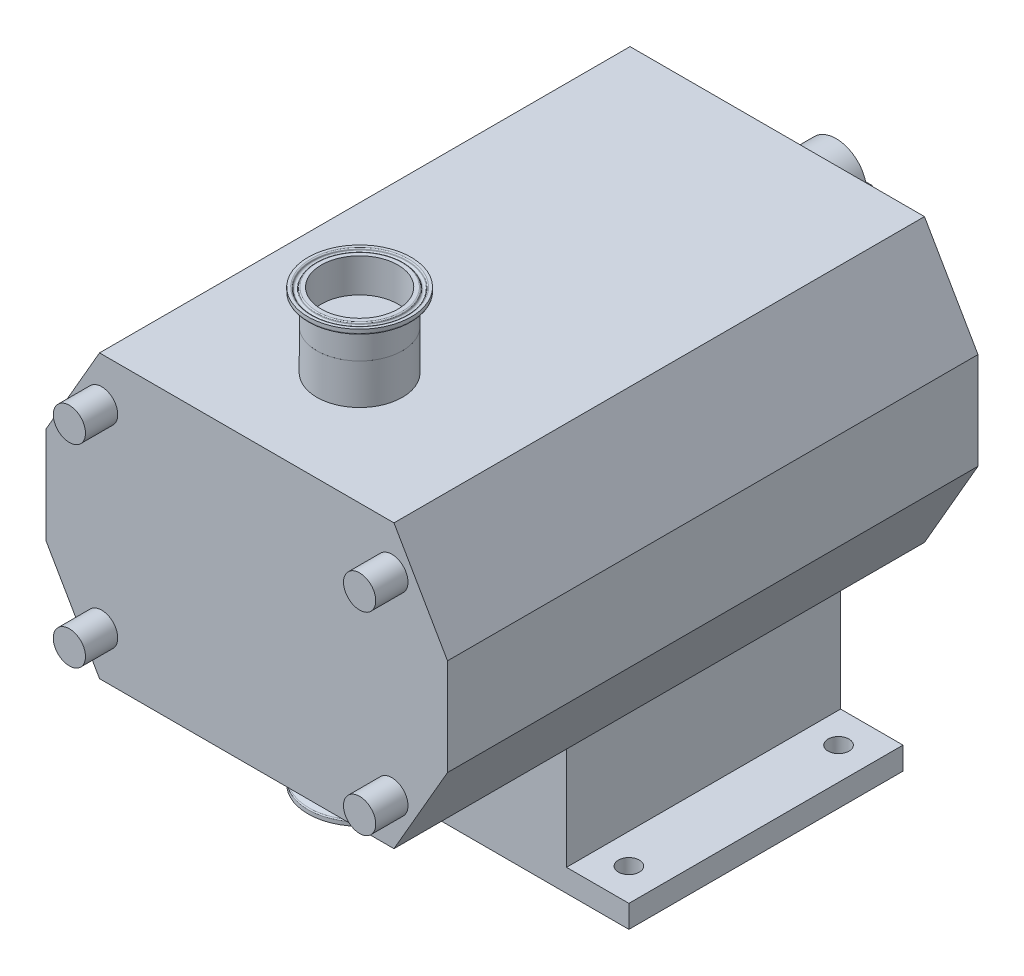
ISO-10303-21;
HEADER;
FILE_DESCRIPTION(('STEP AP214'),'2;1');
FILE_NAME('part.step','',(''),(''),'','','');
FILE_SCHEMA(('AUTOMOTIVE_DESIGN { 1 0 10303 214 1 1 1 1 }'));
ENDSEC;
DATA;
#1=APPLICATION_CONTEXT('core data for automotive mechanical design processes');
#2=APPLICATION_PROTOCOL_DEFINITION('international standard','automotive_design',2000,#1);
#3=PRODUCT_CONTEXT('',#1,'mechanical');
#4=PRODUCT('Part','Part','',(#3));
#5=PRODUCT_RELATED_PRODUCT_CATEGORY('part','',(#4));
#6=PRODUCT_DEFINITION_FORMATION('','',#4);
#7=PRODUCT_DEFINITION_CONTEXT('part definition',#1,'design');
#8=PRODUCT_DEFINITION('design','',#6,#7);
#9=PRODUCT_DEFINITION_SHAPE('','',#8);
#10=(LENGTH_UNIT() NAMED_UNIT(*) SI_UNIT(.MILLI.,.METRE.));
#11=(NAMED_UNIT(*) PLANE_ANGLE_UNIT() SI_UNIT($,.RADIAN.));
#12=(NAMED_UNIT(*) SI_UNIT($,.STERADIAN.) SOLID_ANGLE_UNIT());
#13=UNCERTAINTY_MEASURE_WITH_UNIT(LENGTH_MEASURE(1.E-05),#10,'distance_accuracy_value','');
#14=(GEOMETRIC_REPRESENTATION_CONTEXT(3) GLOBAL_UNCERTAINTY_ASSIGNED_CONTEXT((#13)) GLOBAL_UNIT_ASSIGNED_CONTEXT((#10,
#11,#12)) REPRESENTATION_CONTEXT('',''));
#15=CARTESIAN_POINT('',(0.,0.,0.));
#16=DIRECTION('',(0.,0.,1.));
#17=DIRECTION('',(1.,0.,0.));
#18=AXIS2_PLACEMENT_3D('',#15,#16,#17);
#19=CARTESIAN_POINT('',(13.9682163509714,-133.5,285.835214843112));
#20=DIRECTION('',(0.,-1.,0.));
#21=DIRECTION('',(-0.887028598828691,0.,0.461714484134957));
#22=AXIS2_PLACEMENT_3D('',#19,#20,#21);
#23=PLANE('',#22);
#24=CARTESIAN_POINT('',(0.,-133.5,259.));
#25=DIRECTION('',(0.,-1.,0.));
#26=DIRECTION('',(-0.887028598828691,0.,0.461714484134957));
#27=AXIS2_PLACEMENT_3D('',#24,#25,#26);
#28=CIRCLE('',#27,32.);
#29=CARTESIAN_POINT('',(-28.3849151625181,-133.5,273.774863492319));
#30=VERTEX_POINT('',#29);
#31=EDGE_CURVE('P0_E9',#30,#30,#28,.T.);
#32=ORIENTED_EDGE('',*,*,#31,.T.);
#33=EDGE_LOOP('',(#32));
#34=FACE_BOUND('',#33,.T.);
#35=CARTESIAN_POINT('',(0.,-133.5,259.));
#36=DIRECTION('',(0.,-1.,0.));
#37=DIRECTION('',(-0.887028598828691,0.,0.461714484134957));
#38=AXIS2_PLACEMENT_3D('',#35,#36,#37);
#39=CIRCLE('',#38,30.2529308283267);
#40=CARTESIAN_POINT('',(-26.8352148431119,-133.5,272.968216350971));
#41=VERTEX_POINT('',#40);
#42=EDGE_CURVE('P0_E60',#41,#41,#39,.T.);
#43=ORIENTED_EDGE('',*,*,#42,.F.);
#44=EDGE_LOOP('',(#43));
#45=FACE_BOUND('',#44,.T.);
#46=ADVANCED_FACE('P0_F14',(#34,#45),#23,.T.);
#47=CARTESIAN_POINT('',(0.,-133.5,259.));
#48=DIRECTION('',(0.,-1.,0.));
#49=DIRECTION('',(-0.887028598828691,0.,0.461714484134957));
#50=AXIS2_PLACEMENT_3D('',#47,#48,#49);
#51=CYLINDRICAL_SURFACE('',#50,32.);
#52=CARTESIAN_POINT('',(0.,-131.210166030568,259.));
#53=DIRECTION('',(0.,-1.,0.));
#54=DIRECTION('',(-0.887028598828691,0.,0.461714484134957));
#55=AXIS2_PLACEMENT_3D('',#52,#53,#54);
#56=CIRCLE('',#55,32.);
#57=CARTESIAN_POINT('',(-28.3849151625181,-131.210166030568,273.774863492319));
#58=VERTEX_POINT('',#57);
#59=EDGE_CURVE('P0_E20',#58,#58,#56,.T.);
#60=ORIENTED_EDGE('',*,*,#59,.T.);
#61=EDGE_LOOP('',(#60));
#62=FACE_BOUND('',#61,.T.);
#63=ORIENTED_EDGE('',*,*,#31,.F.);
#64=EDGE_LOOP('',(#63));
#65=FACE_BOUND('',#64,.T.);
#66=ADVANCED_FACE('P0_F68',(#62,#65),#51,.T.);
#67=CARTESIAN_POINT('',(0.,-131.210166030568,259.));
#68=DIRECTION('',(0.,-1.,0.));
#69=DIRECTION('',(-0.887028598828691,0.,0.461714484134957));
#70=AXIS2_PLACEMENT_3D('',#67,#68,#69);
#71=TOROIDAL_SURFACE('',#70,31.2,0.8);
#72=CARTESIAN_POINT('',(0.,-130.458411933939,259.));
#73=DIRECTION('',(0.,-1.,0.));
#74=DIRECTION('',(-0.887028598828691,0.,0.461714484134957));
#75=AXIS2_PLACEMENT_3D('',#72,#73,#74);
#76=CIRCLE('',#75,31.4736161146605);
#77=CARTESIAN_POINT('',(-27.9179976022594,-130.458411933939,273.531824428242));
#78=VERTEX_POINT('',#77);
#79=EDGE_CURVE('P0_E24',#78,#78,#76,.T.);
#80=ORIENTED_EDGE('',*,*,#79,.T.);
#81=EDGE_LOOP('',(#80));
#82=FACE_BOUND('',#81,.T.);
#83=ORIENTED_EDGE('',*,*,#59,.F.);
#84=EDGE_LOOP('',(#83));
#85=FACE_BOUND('',#84,.T.);
#86=ADVANCED_FACE('P0_F73',(#82,#85),#71,.T.);
#87=CARTESIAN_POINT('',(0.,-130.458411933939,259.));
#88=DIRECTION('',(0.,-1.,0.));
#89=DIRECTION('',(-0.887028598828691,0.,0.461714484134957));
#90=AXIS2_PLACEMENT_3D('',#87,#88,#89);
#91=CONICAL_SURFACE('',#90,31.4736161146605,1.22173047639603);
#92=CARTESIAN_POINT('',(0.,-129.127133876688,259.));
#93=DIRECTION('',(0.,-1.,0.));
#94=DIRECTION('',(-0.887028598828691,0.,0.461714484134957));
#95=AXIS2_PLACEMENT_3D('',#92,#93,#94);
#96=CIRCLE('',#95,27.8159597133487);
#97=CARTESIAN_POINT('',(-24.6735517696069,-129.127133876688,271.843031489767));
#98=VERTEX_POINT('',#97);
#99=EDGE_CURVE('P0_E28',#98,#98,#96,.T.);
#100=ORIENTED_EDGE('',*,*,#99,.T.);
#101=EDGE_LOOP('',(#100));
#102=FACE_BOUND('',#101,.T.);
#103=ORIENTED_EDGE('',*,*,#79,.F.);
#104=EDGE_LOOP('',(#103));
#105=FACE_BOUND('',#104,.T.);
#106=ADVANCED_FACE('P0_F77',(#102,#105),#91,.T.);
#107=CARTESIAN_POINT('',(0.,-127.247748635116,259.));
#108=DIRECTION('',(0.,-1.,0.));
#109=DIRECTION('',(-0.887028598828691,0.,0.461714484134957));
#110=AXIS2_PLACEMENT_3D('',#107,#108,#109);
#111=TOROIDAL_SURFACE('',#110,28.5,2.);
#112=CARTESIAN_POINT('',(0.,-127.247748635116,259.));
#113=DIRECTION('',(0.,-1.,0.));
#114=DIRECTION('',(-0.887028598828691,0.,0.461714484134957));
#115=AXIS2_PLACEMENT_3D('',#112,#113,#114);
#116=CIRCLE('',#115,26.5);
#117=CARTESIAN_POINT('',(-23.5062578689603,-127.247748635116,271.235433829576));
#118=VERTEX_POINT('',#117);
#119=EDGE_CURVE('P0_E33',#118,#118,#116,.T.);
#120=ORIENTED_EDGE('',*,*,#119,.T.);
#121=EDGE_LOOP('',(#120));
#122=FACE_BOUND('',#121,.T.);
#123=ORIENTED_EDGE('',*,*,#99,.F.);
#124=EDGE_LOOP('',(#123));
#125=FACE_BOUND('',#124,.T.);
#126=ADVANCED_FACE('P0_F84',(#122,#125),#111,.F.);
#127=CARTESIAN_POINT('',(0.,-133.5,259.));
#128=DIRECTION('',(0.,-1.,0.));
#129=DIRECTION('',(-0.887028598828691,0.,0.461714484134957));
#130=AXIS2_PLACEMENT_3D('',#127,#128,#129);
#131=CYLINDRICAL_SURFACE('',#130,26.5);
#132=CARTESIAN_POINT('',(0.,-112.5,259.));
#133=DIRECTION('',(0.,-1.,0.));
#134=DIRECTION('',(-0.887028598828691,0.,0.461714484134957));
#135=AXIS2_PLACEMENT_3D('',#132,#133,#134);
#136=CIRCLE('',#135,26.5);
#137=CARTESIAN_POINT('',(-23.5062578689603,-112.5,271.235433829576));
#138=VERTEX_POINT('',#137);
#139=EDGE_CURVE('P0_E36',#138,#138,#136,.T.);
#140=ORIENTED_EDGE('',*,*,#139,.T.);
#141=EDGE_LOOP('',(#140));
#142=FACE_BOUND('',#141,.T.);
#143=ORIENTED_EDGE('',*,*,#119,.F.);
#144=EDGE_LOOP('',(#143));
#145=FACE_BOUND('',#144,.T.);
#146=ADVANCED_FACE('P0_F88',(#142,#145),#131,.T.);
#147=CARTESIAN_POINT('',(10.9657189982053,-112.5,280.066929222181));
#148=DIRECTION('',(0.,1.,0.));
#149=DIRECTION('',(0.887028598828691,0.,-0.461714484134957));
#150=AXIS2_PLACEMENT_3D('',#147,#148,#149);
#151=PLANE('',#150);
#152=CARTESIAN_POINT('',(0.,-112.5,259.));
#153=DIRECTION('',(0.,-1.,0.));
#154=DIRECTION('',(-0.887028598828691,0.,0.461714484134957));
#155=AXIS2_PLACEMENT_3D('',#152,#153,#154);
#156=CIRCLE('',#155,23.75);
#157=CARTESIAN_POINT('',(-21.0669292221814,-112.5,269.965718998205));
#158=VERTEX_POINT('',#157);
#159=EDGE_CURVE('P0_E39',#158,#158,#156,.T.);
#160=ORIENTED_EDGE('',*,*,#159,.T.);
#161=EDGE_LOOP('',(#160));
#162=FACE_BOUND('',#161,.T.);
#163=ORIENTED_EDGE('',*,*,#139,.F.);
#164=EDGE_LOOP('',(#163));
#165=FACE_BOUND('',#164,.T.);
#166=ADVANCED_FACE('P0_F92',(#162,#165),#151,.T.);
#167=CARTESIAN_POINT('',(0.,-133.5,259.));
#168=DIRECTION('',(0.,-1.,0.));
#169=DIRECTION('',(-0.887028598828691,0.,0.461714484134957));
#170=AXIS2_PLACEMENT_3D('',#167,#168,#169);
#171=CYLINDRICAL_SURFACE('',#170,23.75);
#172=CARTESIAN_POINT('',(0.,-133.5,259.));
#173=DIRECTION('',(0.,-1.,0.));
#174=DIRECTION('',(-0.887028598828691,0.,0.461714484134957));
#175=AXIS2_PLACEMENT_3D('',#172,#173,#174);
#176=CIRCLE('',#175,23.75);
#177=CARTESIAN_POINT('',(-21.0669292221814,-133.5,269.965718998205));
#178=VERTEX_POINT('',#177);
#179=EDGE_CURVE('P0_E42',#178,#178,#176,.T.);
#180=ORIENTED_EDGE('',*,*,#179,.T.);
#181=EDGE_LOOP('',(#180));
#182=FACE_BOUND('',#181,.T.);
#183=ORIENTED_EDGE('',*,*,#159,.F.);
#184=EDGE_LOOP('',(#183));
#185=FACE_BOUND('',#184,.T.);
#186=ADVANCED_FACE('P0_F96',(#182,#185),#171,.F.);
#187=CARTESIAN_POINT('',(10.9657189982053,-133.5,280.066929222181));
#188=DIRECTION('',(0.,-1.,0.));
#189=DIRECTION('',(-0.887028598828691,0.,0.461714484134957));
#190=AXIS2_PLACEMENT_3D('',#187,#188,#189);
#191=PLANE('',#190);
#192=CARTESIAN_POINT('',(0.,-133.5,259.));
#193=DIRECTION('',(0.,-1.,0.));
#194=DIRECTION('',(-0.887028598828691,0.,0.461714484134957));
#195=AXIS2_PLACEMENT_3D('',#192,#193,#194);
#196=CIRCLE('',#195,26.2470691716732);
#197=CARTESIAN_POINT('',(-23.281900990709,-133.5,271.118652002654));
#198=VERTEX_POINT('',#197);
#199=EDGE_CURVE('P0_E45',#198,#198,#196,.T.);
#200=ORIENTED_EDGE('',*,*,#199,.T.);
#201=EDGE_LOOP('',(#200));
#202=FACE_BOUND('',#201,.T.);
#203=ORIENTED_EDGE('',*,*,#179,.F.);
#204=EDGE_LOOP('',(#203));
#205=FACE_BOUND('',#204,.T.);
#206=ADVANCED_FACE('P0_F100',(#202,#205),#191,.T.);
#207=CARTESIAN_POINT('',(0.,-132.7,259.));
#208=DIRECTION('',(0.,-1.,0.));
#209=DIRECTION('',(-0.887028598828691,0.,0.461714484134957));
#210=AXIS2_PLACEMENT_3D('',#207,#208,#209);
#211=TOROIDAL_SURFACE('',#210,26.2470691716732,0.800000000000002);
#212=CARTESIAN_POINT('',(0.,-133.012584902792,259.));
#213=DIRECTION('',(0.,-1.,0.));
#214=DIRECTION('',(-0.887028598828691,0.,0.461714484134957));
#215=AXIS2_PLACEMENT_3D('',#212,#213,#214);
#216=CIRCLE('',#215,26.9834730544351);
#217=CARTESIAN_POINT('',(-23.9351122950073,-133.012584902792,271.458660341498));
#218=VERTEX_POINT('',#217);
#219=EDGE_CURVE('P0_E48',#218,#218,#216,.T.);
#220=ORIENTED_EDGE('',*,*,#219,.T.);
#221=EDGE_LOOP('',(#220));
#222=FACE_BOUND('',#221,.T.);
#223=ORIENTED_EDGE('',*,*,#199,.F.);
#224=EDGE_LOOP('',(#223));
#225=FACE_BOUND('',#224,.T.);
#226=ADVANCED_FACE('P0_F104',(#222,#225),#211,.T.);
#227=CARTESIAN_POINT('',(0.,-133.012584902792,259.));
#228=DIRECTION('',(0.,1.,0.));
#229=DIRECTION('',(0.887028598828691,0.,-0.461714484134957));
#230=AXIS2_PLACEMENT_3D('',#227,#228,#229);
#231=CONICAL_SURFACE('',#230,26.9834730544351,0.40142572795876);
#232=CARTESIAN_POINT('',(0.,-132.631122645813,259.));
#233=DIRECTION('',(0.,-1.,0.));
#234=DIRECTION('',(-0.887028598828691,0.,0.461714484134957));
#235=AXIS2_PLACEMENT_3D('',#232,#233,#234);
#236=CIRCLE('',#235,27.1453941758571);
#237=CARTESIAN_POINT('',(-24.078740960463,-132.631122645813,271.533421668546));
#238=VERTEX_POINT('',#237);
#239=EDGE_CURVE('P0_E51',#238,#238,#236,.T.);
#240=ORIENTED_EDGE('',*,*,#239,.T.);
#241=EDGE_LOOP('',(#240));
#242=FACE_BOUND('',#241,.T.);
#243=ORIENTED_EDGE('',*,*,#219,.F.);
#244=EDGE_LOOP('',(#243));
#245=FACE_BOUND('',#244,.T.);
#246=ADVANCED_FACE('P0_F108',(#242,#245),#231,.T.);
#247=CARTESIAN_POINT('',(0.,-133.1,259.));
#248=DIRECTION('',(0.,-1.,0.));
#249=DIRECTION('',(-0.887028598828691,0.,0.461714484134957));
#250=AXIS2_PLACEMENT_3D('',#247,#248,#249);
#251=TOROIDAL_SURFACE('',#250,28.25,1.2);
#252=CARTESIAN_POINT('',(0.,-132.631122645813,259.));
#253=DIRECTION('',(0.,-1.,0.));
#254=DIRECTION('',(-0.887028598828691,0.,0.461714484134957));
#255=AXIS2_PLACEMENT_3D('',#252,#253,#254);
#256=CIRCLE('',#255,29.354605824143);
#257=CARTESIAN_POINT('',(-26.038374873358,-132.631122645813,272.553446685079));
#258=VERTEX_POINT('',#257);
#259=EDGE_CURVE('P0_E54',#258,#258,#256,.T.);
#260=ORIENTED_EDGE('',*,*,#259,.T.);
#261=EDGE_LOOP('',(#260));
#262=FACE_BOUND('',#261,.T.);
#263=ORIENTED_EDGE('',*,*,#239,.F.);
#264=EDGE_LOOP('',(#263));
#265=FACE_BOUND('',#264,.T.);
#266=ADVANCED_FACE('P0_F112',(#262,#265),#251,.F.);
#267=CARTESIAN_POINT('',(0.,-132.631122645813,259.));
#268=DIRECTION('',(0.,-1.,0.));
#269=DIRECTION('',(-0.887028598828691,0.,0.461714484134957));
#270=AXIS2_PLACEMENT_3D('',#267,#268,#269);
#271=CONICAL_SURFACE('',#270,29.354605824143,0.401425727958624);
#272=CARTESIAN_POINT('',(0.,-133.012584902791,259.));
#273=DIRECTION('',(0.,-1.,0.));
#274=DIRECTION('',(-0.887028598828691,0.,0.461714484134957));
#275=AXIS2_PLACEMENT_3D('',#272,#273,#274);
#276=CIRCLE('',#275,29.5165269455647);
#277=CARTESIAN_POINT('',(-26.1820035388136,-133.012584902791,272.628208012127));
#278=VERTEX_POINT('',#277);
#279=EDGE_CURVE('P0_E57',#278,#278,#276,.T.);
#280=ORIENTED_EDGE('',*,*,#279,.T.);
#281=EDGE_LOOP('',(#280));
#282=FACE_BOUND('',#281,.T.);
#283=ORIENTED_EDGE('',*,*,#259,.F.);
#284=EDGE_LOOP('',(#283));
#285=FACE_BOUND('',#284,.T.);
#286=ADVANCED_FACE('P0_F116',(#282,#285),#271,.F.);
#287=CARTESIAN_POINT('',(0.,-132.7,259.));
#288=DIRECTION('',(0.,-1.,0.));
#289=DIRECTION('',(-0.887028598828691,0.,0.461714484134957));
#290=AXIS2_PLACEMENT_3D('',#287,#288,#289);
#291=TOROIDAL_SURFACE('',#290,30.2529308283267,0.8);
#292=ORIENTED_EDGE('',*,*,#42,.T.);
#293=EDGE_LOOP('',(#292));
#294=FACE_BOUND('',#293,.T.);
#295=ORIENTED_EDGE('',*,*,#279,.F.);
#296=EDGE_LOOP('',(#295));
#297=FACE_BOUND('',#296,.T.);
#298=ADVANCED_FACE('P0_F64',(#294,#297),#291,.T.);
#299=CLOSED_SHELL('',(#46,#66,#86,#106,#126,#146,#166,#186,#206,#226,#246,#266,#286,#298));
#300=MANIFOLD_SOLID_BREP('P0_B1',#299);
#301=CARTESIAN_POINT('',(-46.5,0.,241.732657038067));
#302=DIRECTION('',(0.,0.,1.));
#303=DIRECTION('',(1.,0.,0.));
#304=AXIS2_PLACEMENT_3D('',#301,#302,#303);
#305=CYLINDRICAL_SURFACE('',#304,19.);
#306=CARTESIAN_POINT('',(-46.5,0.,-3.));
#307=DIRECTION('',(0.,0.,1.));
#308=DIRECTION('',(1.,0.,0.));
#309=AXIS2_PLACEMENT_3D('',#306,#307,#308);
#310=CIRCLE('',#309,19.);
#311=CARTESIAN_POINT('',(-27.5,0.,-3.));
#312=VERTEX_POINT('',#311);
#313=EDGE_CURVE('P1_E277',#312,#312,#310,.T.);
#314=ORIENTED_EDGE('',*,*,#313,.F.);
#315=EDGE_LOOP('',(#314));
#316=FACE_BOUND('',#315,.T.);
#317=DIRECTION('',(0.,0.,1.));
#318=VECTOR('',#317,1.);
#319=CARTESIAN_POINT('',(-28.1696972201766,4.99999999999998,241.732657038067));
#320=LINE('',#319,#318);
#321=CARTESIAN_POINT('',(-28.1696972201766,5.,-83.));
#322=VERTEX_POINT('',#321);
#323=CARTESIAN_POINT('',(-28.1696972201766,5.,-43.));
#324=VERTEX_POINT('',#323);
#325=EDGE_CURVE('P1_E178',#322,#324,#320,.T.);
#326=ORIENTED_EDGE('',*,*,#325,.F.);
#327=CARTESIAN_POINT('',(-46.5,0.,-83.));
#328=DIRECTION('',(0.,0.,1.));
#329=DIRECTION('',(1.,0.,0.));
#330=AXIS2_PLACEMENT_3D('',#327,#328,#329);
#331=CIRCLE('',#330,19.);
#332=CARTESIAN_POINT('',(-28.1696972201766,-5.,-83.));
#333=VERTEX_POINT('',#332);
#334=EDGE_CURVE('P1_E176',#322,#333,#331,.T.);
#335=ORIENTED_EDGE('',*,*,#334,.T.);
#336=DIRECTION('',(0.,0.,1.));
#337=VECTOR('',#336,1.);
#338=CARTESIAN_POINT('',(-28.1696972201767,-5.00000000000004,241.732657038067));
#339=LINE('',#338,#337);
#340=CARTESIAN_POINT('',(-28.1696972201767,-5.00000000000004,-43.));
#341=VERTEX_POINT('',#340);
#342=EDGE_CURVE('P1_E39',#341,#333,#339,.F.);
#343=ORIENTED_EDGE('',*,*,#342,.F.);
#344=CARTESIAN_POINT('',(-27.5,0.,-48.));
#345=CARTESIAN_POINT('',(-27.5000042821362,0.275769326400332,-47.9999931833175));
#346=CARTESIAN_POINT('',(-27.5060630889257,0.551612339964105,-47.9771088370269));
#347=CARTESIAN_POINT('',(-27.5296447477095,1.09536084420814,-47.8863327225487));
#348=CARTESIAN_POINT('',(-27.5471733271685,1.36326229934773,-47.8184184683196));
#349=CARTESIAN_POINT('',(-27.5917584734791,1.88319959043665,-47.6399368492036));
#350=CARTESIAN_POINT('',(-27.6188029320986,2.13525511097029,-47.5294236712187));
#351=CARTESIAN_POINT('',(-27.6795569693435,2.61725305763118,-47.2690799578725));
#352=CARTESIAN_POINT('',(-27.7132669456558,2.84719416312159,-47.1192470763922));
#353=CARTESIAN_POINT('',(-27.7845611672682,3.28363987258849,-46.7809367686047));
#354=CARTESIAN_POINT('',(-27.8222102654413,3.48957269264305,-46.591735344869));
#355=CARTESIAN_POINT('',(-27.8967199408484,3.86718169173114,-46.1816068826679));
#356=CARTESIAN_POINT('',(-27.9335804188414,4.03885358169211,-45.9606758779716));
#357=CARTESIAN_POINT('',(-28.0030006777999,4.34583417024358,-45.4888224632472));
#358=CARTESIAN_POINT('',(-28.0354785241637,4.48048899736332,-45.237461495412));
#359=CARTESIAN_POINT('',(-28.0915043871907,4.7054029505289,-44.7146757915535));
#360=CARTESIAN_POINT('',(-28.1150540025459,4.79567002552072,-44.4432546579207));
#361=CARTESIAN_POINT('',(-28.1498881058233,4.92726790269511,-43.894376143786));
#362=CARTESIAN_POINT('',(-28.1614315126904,4.96963355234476,-43.6171837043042));
#363=CARTESIAN_POINT('',(-28.171720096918,5.00745164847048,-43.0594039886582));
#364=CARTESIAN_POINT('',(-28.1704675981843,5.00291261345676,-42.7788173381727));
#365=CARTESIAN_POINT('',(-28.1555378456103,4.9478726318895,-42.2302595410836));
#366=CARTESIAN_POINT('',(-28.1421979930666,4.89861973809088,-41.9621525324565));
#367=CARTESIAN_POINT('',(-28.1051362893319,4.75754734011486,-41.4381479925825));
#368=CARTESIAN_POINT('',(-28.0814136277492,4.6657245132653,-41.1822514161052));
#369=CARTESIAN_POINT('',(-28.0259597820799,4.4410917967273,-40.6866584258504));
#370=CARTESIAN_POINT('',(-27.9941431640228,4.30784106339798,-40.4471717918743));
#371=CARTESIAN_POINT('',(-27.926132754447,4.00444274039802,-39.9935172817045));
#372=CARTESIAN_POINT('',(-27.8899381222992,3.83428805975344,-39.7793542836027));
#373=CARTESIAN_POINT('',(-27.8158419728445,3.45551254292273,-39.3752910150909));
#374=CARTESIAN_POINT('',(-27.7779227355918,3.24584253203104,-39.1863761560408));
#375=CARTESIAN_POINT('',(-27.705680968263,2.79733618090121,-38.8461906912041));
#376=CARTESIAN_POINT('',(-27.671358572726,2.55849875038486,-38.6949214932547));
#377=CARTESIAN_POINT('',(-27.6099756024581,2.05693717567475,-38.4339031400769));
#378=CARTESIAN_POINT('',(-27.5829456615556,1.79411828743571,-38.3243283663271));
#379=CARTESIAN_POINT('',(-27.5394148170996,1.25291705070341,-38.151199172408));
#380=CARTESIAN_POINT('',(-27.5229116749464,0.974538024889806,-38.0876349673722));
#381=CARTESIAN_POINT('',(-27.5026308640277,0.418531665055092,-38.009869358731));
#382=CARTESIAN_POINT('',(-27.4985077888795,0.141104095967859,-37.9943277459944));
#383=CARTESIAN_POINT('',(-27.5024606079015,-0.412392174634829,-38.0093527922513));
#384=CARTESIAN_POINT('',(-27.5105352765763,-0.688461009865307,-38.0399148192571));
#385=CARTESIAN_POINT('',(-27.5377535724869,-1.22664703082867,-38.1451790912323));
#386=CARTESIAN_POINT('',(-27.5567105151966,-1.48892004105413,-38.2191373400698));
#387=CARTESIAN_POINT('',(-27.6035461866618,-1.99731390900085,-38.4082337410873));
#388=CARTESIAN_POINT('',(-27.6314258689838,-2.24343303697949,-38.5233762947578));
#389=CARTESIAN_POINT('',(-27.6938277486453,-2.71776721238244,-38.7940826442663));
#390=CARTESIAN_POINT('',(-27.7284672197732,-2.9455476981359,-38.9503801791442));
#391=CARTESIAN_POINT('',(-27.8003827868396,-3.3721194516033,-39.298034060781));
#392=CARTESIAN_POINT('',(-27.8376593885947,-3.5709051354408,-39.4893971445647));
#393=CARTESIAN_POINT('',(-27.9119129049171,-3.93946537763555,-39.9079980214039));
#394=CARTESIAN_POINT('',(-27.9488536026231,-4.10829545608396,-40.1360753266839));
#395=CARTESIAN_POINT('',(-28.0171260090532,-4.40530154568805,-40.6181009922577));
#396=CARTESIAN_POINT('',(-28.048457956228,-4.5334792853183,-40.8720482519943));
#397=CARTESIAN_POINT('',(-28.1016076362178,-4.74457728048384,-41.3973124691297));
#398=CARTESIAN_POINT('',(-28.1234807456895,-4.82776168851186,-41.6685173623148));
#399=CARTESIAN_POINT('',(-28.1552579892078,-4.94715371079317,-42.2217364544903));
#400=CARTESIAN_POINT('',(-28.1651650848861,-4.98337294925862,-42.5037479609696));
#401=CARTESIAN_POINT('',(-28.1716457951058,-5.00715081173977,-43.0609183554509));
#402=CARTESIAN_POINT('',(-28.1686348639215,-4.99622557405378,-43.3360086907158));
#403=CARTESIAN_POINT('',(-28.1505888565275,-4.92953140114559,-43.8802760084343));
#404=CARTESIAN_POINT('',(-28.1355540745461,-4.87376356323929,-44.1494531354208));
#405=CARTESIAN_POINT('',(-28.095398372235,-4.71983552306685,-44.6724009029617));
#406=CARTESIAN_POINT('',(-28.0703520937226,-4.6219886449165,-44.9262699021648));
#407=CARTESIAN_POINT('',(-28.012991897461,-4.38692411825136,-45.4141783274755));
#408=CARTESIAN_POINT('',(-27.9806768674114,-4.24970044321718,-45.648214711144));
#409=CARTESIAN_POINT('',(-27.9112611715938,-3.93514861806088,-46.0970708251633));
#410=CARTESIAN_POINT('',(-27.8740497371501,-3.7567820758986,-46.3111458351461));
#411=CARTESIAN_POINT('',(-27.7996615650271,-3.36699304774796,-46.7068188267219));
#412=CARTESIAN_POINT('',(-27.7624848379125,-3.15556257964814,-46.8884089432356));
#413=CARTESIAN_POINT('',(-27.6914364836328,-2.7003741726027,-47.2176404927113));
#414=CARTESIAN_POINT('',(-27.6576490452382,-2.45603841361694,-47.3645027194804));
#415=CARTESIAN_POINT('',(-27.5980996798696,-1.94526775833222,-47.6148349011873));
#416=CARTESIAN_POINT('',(-27.5723324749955,-1.67884754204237,-47.7183334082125));
#417=CARTESIAN_POINT('',(-27.5351625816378,-1.17775159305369,-47.8650961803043));
#418=CARTESIAN_POINT('',(-27.5220714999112,-0.945286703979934,-47.9155694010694));
#419=CARTESIAN_POINT('',(-27.5044887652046,-0.47523246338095,-47.9830226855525));
#420=CARTESIAN_POINT('',(-27.4999963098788,-0.237643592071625,-48.0000058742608));
#421=CARTESIAN_POINT('',(-27.5,0.,-48.));
#422=B_SPLINE_CURVE_WITH_KNOTS('',3,(#344,#345,#346,#347,#348,#349,#350,#351,#352,#353,#354,
#355,#356,#357,#358,#359,#360,#361,#362,#363,#364,#365,#366,#367,#368,#369,#370,#371,#372,#373,
#374,#375,#376,#377,#378,#379,#380,#381,#382,#383,#384,#385,#386,#387,#388,#389,#390,#391,#392,
#393,#394,#395,#396,#397,#398,#399,#400,#401,#402,#403,#404,#405,#406,#407,#408,#409,#410,#411,
#412,#413,#414,#415,#416,#417,#418,#419,#420,#421),.UNSPECIFIED.,.T.,.F.,(4,2,2,2,2,2,2,2,2,2,2,
2,2,2,2,2,2,2,2,2,2,2,2,2,2,2,2,2,2,2,2,2,2,2,2,2,2,2,4),(0.,0.826436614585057,1.65328622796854,
2.47908752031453,3.30493809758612,4.14758534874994,4.99033802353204,5.84713921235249,
6.70378690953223,7.54155141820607,8.37916378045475,9.19409222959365,10.0090842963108,
10.8330642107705,11.6572025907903,12.5074895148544,13.35780823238,14.2116451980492,
15.0653005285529,15.8949065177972,16.7244291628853,17.5401294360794,18.3559169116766,
19.187369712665,20.0189824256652,20.873388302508,21.7277578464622,22.577055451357,
23.4261428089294,24.2481310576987,25.0700991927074,25.8860500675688,26.702125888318,
27.5416338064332,28.3813447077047,29.2384104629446,30.0949110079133,30.8071573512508,
31.5193372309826),.UNSPECIFIED.);
#423=EDGE_CURVE('P1_E11',#324,#341,#422,.T.);
#424=ORIENTED_EDGE('',*,*,#423,.F.);
#425=EDGE_LOOP('',(#326,#335,#343,#424));
#426=FACE_BOUND('',#425,.T.);
#427=ADVANCED_FACE('P1_F17',(#316,#426),#305,.T.);
#428=CARTESIAN_POINT('',(-91.3023595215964,-87.5,329.));
#429=DIRECTION('',(0.,1.,0.));
#430=DIRECTION('',(-1.,0.,0.));
#431=AXIS2_PLACEMENT_3D('',#428,#429,#430);
#432=PLANE('',#431);
#433=CARTESIAN_POINT('',(0.,-87.5,259.));
#434=DIRECTION('',(0.,1.,0.));
#435=DIRECTION('',(-1.,0.,0.));
#436=AXIS2_PLACEMENT_3D('',#433,#434,#435);
#437=CIRCLE('',#436,26.5);
#438=CARTESIAN_POINT('',(-26.5,-87.5,259.));
#439=VERTEX_POINT('',#438);
#440=EDGE_CURVE('P1_E192',#439,#439,#437,.T.);
#441=ORIENTED_EDGE('',*,*,#440,.T.);
#442=EDGE_LOOP('',(#441));
#443=FACE_BOUND('',#442,.T.);
#444=DIRECTION('',(1.,0.,0.));
#445=VECTOR('',#444,1.);
#446=CARTESIAN_POINT('',(-91.3023595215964,-87.5,0.));
#447=LINE('',#446,#445);
#448=CARTESIAN_POINT('',(-91.3023595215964,-87.5,0.));
#449=VERTEX_POINT('',#448);
#450=CARTESIAN_POINT('',(91.3023595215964,-87.5,0.));
#451=VERTEX_POINT('',#450);
#452=EDGE_CURVE('P1_E328',#449,#451,#447,.T.);
#453=ORIENTED_EDGE('',*,*,#452,.T.);
#454=DIRECTION('',(0.,0.,-1.));
#455=VECTOR('',#454,1.);
#456=CARTESIAN_POINT('',(91.3023595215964,-87.5,329.));
#457=LINE('',#456,#455);
#458=CARTESIAN_POINT('',(91.3023595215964,-87.5,329.));
#459=VERTEX_POINT('',#458);
#460=EDGE_CURVE('P1_E338',#459,#451,#457,.T.);
#461=ORIENTED_EDGE('',*,*,#460,.F.);
#462=DIRECTION('',(1.,0.,0.));
#463=VECTOR('',#462,1.);
#464=CARTESIAN_POINT('',(-91.3023595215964,-87.5,329.));
#465=LINE('',#464,#463);
#466=CARTESIAN_POINT('',(-91.3023595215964,-87.5,329.));
#467=VERTEX_POINT('',#466);
#468=EDGE_CURVE('P1_E311',#467,#459,#465,.T.);
#469=ORIENTED_EDGE('',*,*,#468,.F.);
#470=DIRECTION('',(0.,0.,-1.));
#471=VECTOR('',#470,1.);
#472=CARTESIAN_POINT('',(-91.3023595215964,-87.5,329.));
#473=LINE('',#472,#471);
#474=EDGE_CURVE('P1_E341',#467,#449,#473,.T.);
#475=ORIENTED_EDGE('',*,*,#474,.T.);
#476=EDGE_LOOP('',(#453,#461,#469,#475));
#477=FACE_BOUND('',#476,.T.);
#478=DIRECTION('',(1.,0.,0.));
#479=VECTOR('',#478,1.);
#480=CARTESIAN_POINT('',(66.3023595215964,-87.5,27.));
#481=LINE('',#480,#479);
#482=CARTESIAN_POINT('',(-66.3023595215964,-87.5,27.));
#483=VERTEX_POINT('',#482);
#484=CARTESIAN_POINT('',(66.3023595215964,-87.5,27.));
#485=VERTEX_POINT('',#484);
#486=EDGE_CURVE('P1_E220',#483,#485,#481,.T.);
#487=ORIENTED_EDGE('',*,*,#486,.F.);
#488=DIRECTION('',(0.,0.,1.));
#489=VECTOR('',#488,1.);
#490=CARTESIAN_POINT('',(-66.3023595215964,-87.5,27.));
#491=LINE('',#490,#489);
#492=CARTESIAN_POINT('',(-66.3023595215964,-87.5,197.));
#493=VERTEX_POINT('',#492);
#494=EDGE_CURVE('P1_E238',#483,#493,#491,.T.);
#495=ORIENTED_EDGE('',*,*,#494,.T.);
#496=DIRECTION('',(1.,0.,0.));
#497=VECTOR('',#496,1.);
#498=CARTESIAN_POINT('',(66.3023595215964,-87.5,197.));
#499=LINE('',#498,#497);
#500=CARTESIAN_POINT('',(66.3023595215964,-87.5,197.));
#501=VERTEX_POINT('',#500);
#502=EDGE_CURVE('P1_E219',#493,#501,#499,.T.);
#503=ORIENTED_EDGE('',*,*,#502,.T.);
#504=DIRECTION('',(0.,0.,1.));
#505=VECTOR('',#504,1.);
#506=CARTESIAN_POINT('',(66.3023595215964,-87.5,27.));
#507=LINE('',#506,#505);
#508=EDGE_CURVE('P1_E274',#485,#501,#507,.T.);
#509=ORIENTED_EDGE('',*,*,#508,.F.);
#510=EDGE_LOOP('',(#487,#495,#503,#509));
#511=FACE_BOUND('',#510,.T.);
#512=ADVANCED_FACE('P1_F393',(#443,#477,#511),#432,.F.);
#513=CARTESIAN_POINT('',(0.,245.640325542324,0.));
#514=DIRECTION('',(0.,0.,-1.));
#515=DIRECTION('',(-1.,0.,0.));
#516=AXIS2_PLACEMENT_3D('',#513,#514,#515);
#517=PLANE('',#516);
#518=DIRECTION('',(-0.500000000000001,0.866025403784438,0.));
#519=VECTOR('',#518,1.);
#520=CARTESIAN_POINT('',(91.3023595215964,87.5,0.));
#521=LINE('',#520,#519);
#522=CARTESIAN_POINT('',(124.5,30.,0.));
#523=VERTEX_POINT('',#522);
#524=CARTESIAN_POINT('',(91.3023595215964,87.5,0.));
#525=VERTEX_POINT('',#524);
#526=EDGE_CURVE('P1_E298',#523,#525,#521,.T.);
#527=ORIENTED_EDGE('',*,*,#526,.F.);
#528=DIRECTION('',(0.,1.,0.));
#529=VECTOR('',#528,1.);
#530=CARTESIAN_POINT('',(124.5,30.,0.));
#531=LINE('',#530,#529);
#532=CARTESIAN_POINT('',(124.5,-30.,0.));
#533=VERTEX_POINT('',#532);
#534=EDGE_CURVE('P1_E303',#533,#523,#531,.T.);
#535=ORIENTED_EDGE('',*,*,#534,.F.);
#536=DIRECTION('',(0.500000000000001,0.866025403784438,0.));
#537=VECTOR('',#536,1.);
#538=CARTESIAN_POINT('',(91.3023595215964,-87.5,0.));
#539=LINE('',#538,#537);
#540=EDGE_CURVE('P1_E330',#451,#533,#539,.T.);
#541=ORIENTED_EDGE('',*,*,#540,.F.);
#542=ORIENTED_EDGE('',*,*,#452,.F.);
#543=DIRECTION('',(0.500000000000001,-0.866025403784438,0.));
#544=VECTOR('',#543,1.);
#545=CARTESIAN_POINT('',(-91.3023595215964,-87.5,0.));
#546=LINE('',#545,#544);
#547=CARTESIAN_POINT('',(-124.5,-30.,0.));
#548=VERTEX_POINT('',#547);
#549=EDGE_CURVE('P1_E326',#548,#449,#546,.T.);
#550=ORIENTED_EDGE('',*,*,#549,.F.);
#551=DIRECTION('',(0.,-1.,0.));
#552=VECTOR('',#551,1.);
#553=CARTESIAN_POINT('',(-124.5,30.,0.));
#554=LINE('',#553,#552);
#555=CARTESIAN_POINT('',(-124.5,30.,0.));
#556=VERTEX_POINT('',#555);
#557=EDGE_CURVE('P1_E324',#556,#548,#554,.T.);
#558=ORIENTED_EDGE('',*,*,#557,.F.);
#559=DIRECTION('',(-0.500000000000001,-0.866025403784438,0.));
#560=VECTOR('',#559,1.);
#561=CARTESIAN_POINT('',(-91.3023595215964,87.5,0.));
#562=LINE('',#561,#560);
#563=CARTESIAN_POINT('',(-91.3023595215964,87.5,0.));
#564=VERTEX_POINT('',#563);
#565=EDGE_CURVE('P1_E322',#564,#556,#562,.T.);
#566=ORIENTED_EDGE('',*,*,#565,.F.);
#567=DIRECTION('',(-1.,0.,0.));
#568=VECTOR('',#567,1.);
#569=CARTESIAN_POINT('',(-91.3023595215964,87.5,0.));
#570=LINE('',#569,#568);
#571=EDGE_CURVE('P1_E320',#525,#564,#570,.T.);
#572=ORIENTED_EDGE('',*,*,#571,.F.);
#573=EDGE_LOOP('',(#527,#535,#541,#542,#550,#558,#566,#572));
#574=FACE_BOUND('',#573,.T.);
#575=CARTESIAN_POINT('',(-46.5,0.,0.));
#576=DIRECTION('',(0.,0.,1.));
#577=DIRECTION('',(1.,0.,0.));
#578=AXIS2_PLACEMENT_3D('',#575,#576,#577);
#579=CIRCLE('',#578,22.);
#580=CARTESIAN_POINT('',(-24.5,0.,0.));
#581=VERTEX_POINT('',#580);
#582=EDGE_CURVE('P1_E283',#581,#581,#579,.T.);
#583=ORIENTED_EDGE('',*,*,#582,.T.);
#584=EDGE_LOOP('',(#583));
#585=FACE_BOUND('',#584,.T.);
#586=ADVANCED_FACE('P1_F399',(#574,#585),#517,.T.);
#587=CARTESIAN_POINT('',(0.,245.640325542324,329.));
#588=DIRECTION('',(0.,0.,-1.));
#589=DIRECTION('',(-1.,0.,0.));
#590=AXIS2_PLACEMENT_3D('',#587,#588,#589);
#591=PLANE('',#590);
#592=CARTESIAN_POINT('',(90.,-60.,329.));
#593=DIRECTION('',(0.,0.,-1.));
#594=DIRECTION('',(-1.,0.,0.));
#595=AXIS2_PLACEMENT_3D('',#592,#593,#594);
#596=CIRCLE('',#595,9.99999999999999);
#597=CARTESIAN_POINT('',(80.,-60.,329.));
#598=VERTEX_POINT('',#597);
#599=EDGE_CURVE('P1_E362',#598,#598,#596,.F.);
#600=ORIENTED_EDGE('',*,*,#599,.F.);
#601=EDGE_LOOP('',(#600));
#602=FACE_BOUND('',#601,.T.);
#603=CARTESIAN_POINT('',(-90.,60.,329.));
#604=DIRECTION('',(0.,0.,-1.));
#605=DIRECTION('',(-1.,0.,0.));
#606=AXIS2_PLACEMENT_3D('',#603,#604,#605);
#607=CIRCLE('',#606,9.99999999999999);
#608=CARTESIAN_POINT('',(-100.,60.,329.));
#609=VERTEX_POINT('',#608);
#610=EDGE_CURVE('P1_E356',#609,#609,#607,.F.);
#611=ORIENTED_EDGE('',*,*,#610,.F.);
#612=EDGE_LOOP('',(#611));
#613=FACE_BOUND('',#612,.T.);
#614=DIRECTION('',(-0.500000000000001,0.866025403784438,0.));
#615=VECTOR('',#614,1.);
#616=CARTESIAN_POINT('',(91.3023595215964,87.5,329.));
#617=LINE('',#616,#615);
#618=CARTESIAN_POINT('',(124.5,30.,329.));
#619=VERTEX_POINT('',#618);
#620=CARTESIAN_POINT('',(91.3023595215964,87.5,329.));
#621=VERTEX_POINT('',#620);
#622=EDGE_CURVE('P1_E299',#619,#621,#617,.T.);
#623=ORIENTED_EDGE('',*,*,#622,.T.);
#624=DIRECTION('',(-1.,0.,0.));
#625=VECTOR('',#624,1.);
#626=CARTESIAN_POINT('',(-91.3023595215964,87.5,329.));
#627=LINE('',#626,#625);
#628=CARTESIAN_POINT('',(-91.3023595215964,87.5,329.));
#629=VERTEX_POINT('',#628);
#630=EDGE_CURVE('P1_E302',#621,#629,#627,.T.);
#631=ORIENTED_EDGE('',*,*,#630,.T.);
#632=DIRECTION('',(-0.500000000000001,-0.866025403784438,0.));
#633=VECTOR('',#632,1.);
#634=CARTESIAN_POINT('',(-91.3023595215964,87.5,329.));
#635=LINE('',#634,#633);
#636=CARTESIAN_POINT('',(-124.5,30.,329.));
#637=VERTEX_POINT('',#636);
#638=EDGE_CURVE('P1_E305',#629,#637,#635,.T.);
#639=ORIENTED_EDGE('',*,*,#638,.T.);
#640=DIRECTION('',(0.,-1.,0.));
#641=VECTOR('',#640,1.);
#642=CARTESIAN_POINT('',(-124.5,30.,329.));
#643=LINE('',#642,#641);
#644=CARTESIAN_POINT('',(-124.5,-30.,329.));
#645=VERTEX_POINT('',#644);
#646=EDGE_CURVE('P1_E307',#637,#645,#643,.T.);
#647=ORIENTED_EDGE('',*,*,#646,.T.);
#648=DIRECTION('',(0.500000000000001,-0.866025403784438,0.));
#649=VECTOR('',#648,1.);
#650=CARTESIAN_POINT('',(-91.3023595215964,-87.5,329.));
#651=LINE('',#650,#649);
#652=EDGE_CURVE('P1_E309',#645,#467,#651,.T.);
#653=ORIENTED_EDGE('',*,*,#652,.T.);
#654=ORIENTED_EDGE('',*,*,#468,.T.);
#655=DIRECTION('',(0.500000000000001,0.866025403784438,0.));
#656=VECTOR('',#655,1.);
#657=CARTESIAN_POINT('',(91.3023595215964,-87.5,329.));
#658=LINE('',#657,#656);
#659=CARTESIAN_POINT('',(124.5,-30.,329.));
#660=VERTEX_POINT('',#659);
#661=EDGE_CURVE('P1_E313',#459,#660,#658,.T.);
#662=ORIENTED_EDGE('',*,*,#661,.T.);
#663=DIRECTION('',(0.,1.,0.));
#664=VECTOR('',#663,1.);
#665=CARTESIAN_POINT('',(124.5,30.,329.));
#666=LINE('',#665,#664);
#667=EDGE_CURVE('P1_E315',#660,#619,#666,.T.);
#668=ORIENTED_EDGE('',*,*,#667,.T.);
#669=EDGE_LOOP('',(#623,#631,#639,#647,#653,#654,#662,#668));
#670=FACE_BOUND('',#669,.T.);
#671=CARTESIAN_POINT('',(90.,60.,329.));
#672=DIRECTION('',(0.,0.,-1.));
#673=DIRECTION('',(-1.,0.,0.));
#674=AXIS2_PLACEMENT_3D('',#671,#672,#673);
#675=CIRCLE('',#674,9.99999999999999);
#676=CARTESIAN_POINT('',(80.,60.,329.));
#677=VERTEX_POINT('',#676);
#678=EDGE_CURVE('P1_E359',#677,#677,#675,.F.);
#679=ORIENTED_EDGE('',*,*,#678,.F.);
#680=EDGE_LOOP('',(#679));
#681=FACE_BOUND('',#680,.T.);
#682=CARTESIAN_POINT('',(-90.,-60.,329.));
#683=DIRECTION('',(0.,0.,-1.));
#684=DIRECTION('',(-1.,0.,0.));
#685=AXIS2_PLACEMENT_3D('',#682,#683,#684);
#686=CIRCLE('',#685,9.99999999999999);
#687=CARTESIAN_POINT('',(-100.,-60.,329.));
#688=VERTEX_POINT('',#687);
#689=EDGE_CURVE('P1_E29',#688,#688,#686,.F.);
#690=ORIENTED_EDGE('',*,*,#689,.F.);
#691=EDGE_LOOP('',(#690));
#692=FACE_BOUND('',#691,.T.);
#693=ADVANCED_FACE('P1_F448',(#602,#613,#670,#681,#692),#591,.F.);
#694=CARTESIAN_POINT('',(91.3023595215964,87.5,329.));
#695=DIRECTION('',(-0.866025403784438,-0.500000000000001,0.));
#696=DIRECTION('',(0.500000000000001,-0.866025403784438,0.));
#697=AXIS2_PLACEMENT_3D('',#694,#695,#696);
#698=PLANE('',#697);
#699=ORIENTED_EDGE('',*,*,#526,.T.);
#700=DIRECTION('',(0.,0.,-1.));
#701=VECTOR('',#700,1.);
#702=CARTESIAN_POINT('',(91.3023595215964,87.5,329.));
#703=LINE('',#702,#701);
#704=EDGE_CURVE('P1_E353',#621,#525,#703,.T.);
#705=ORIENTED_EDGE('',*,*,#704,.F.);
#706=ORIENTED_EDGE('',*,*,#622,.F.);
#707=DIRECTION('',(0.,0.,-1.));
#708=VECTOR('',#707,1.);
#709=CARTESIAN_POINT('',(124.5,30.,329.));
#710=LINE('',#709,#708);
#711=EDGE_CURVE('P1_E317',#619,#523,#710,.T.);
#712=ORIENTED_EDGE('',*,*,#711,.T.);
#713=EDGE_LOOP('',(#699,#705,#706,#712));
#714=FACE_BOUND('',#713,.T.);
#715=ADVANCED_FACE('P1_F19',(#714),#698,.F.);
#716=CARTESIAN_POINT('',(-91.3023595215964,87.5,329.));
#717=DIRECTION('',(0.,-1.,0.));
#718=DIRECTION('',(1.,0.,0.));
#719=AXIS2_PLACEMENT_3D('',#716,#717,#718);
#720=PLANE('',#719);
#721=CARTESIAN_POINT('',(0.,87.5,259.));
#722=DIRECTION('',(0.,-1.,0.));
#723=DIRECTION('',(1.,0.,0.));
#724=AXIS2_PLACEMENT_3D('',#721,#722,#723);
#725=CIRCLE('',#724,26.5);
#726=CARTESIAN_POINT('',(26.5,87.5,259.));
#727=VERTEX_POINT('',#726);
#728=EDGE_CURVE('P1_E191',#727,#727,#725,.T.);
#729=ORIENTED_EDGE('',*,*,#728,.T.);
#730=EDGE_LOOP('',(#729));
#731=FACE_BOUND('',#730,.T.);
#732=ORIENTED_EDGE('',*,*,#571,.T.);
#733=DIRECTION('',(0.,0.,-1.));
#734=VECTOR('',#733,1.);
#735=CARTESIAN_POINT('',(-91.3023595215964,87.5,329.));
#736=LINE('',#735,#734);
#737=EDGE_CURVE('P1_E350',#629,#564,#736,.T.);
#738=ORIENTED_EDGE('',*,*,#737,.F.);
#739=ORIENTED_EDGE('',*,*,#630,.F.);
#740=ORIENTED_EDGE('',*,*,#704,.T.);
#741=EDGE_LOOP('',(#732,#738,#739,#740));
#742=FACE_BOUND('',#741,.T.);
#743=ADVANCED_FACE('P1_F369',(#731,#742),#720,.F.);
#744=CARTESIAN_POINT('',(-91.3023595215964,87.5,329.));
#745=DIRECTION('',(0.866025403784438,-0.500000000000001,0.));
#746=DIRECTION('',(0.500000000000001,0.866025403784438,0.));
#747=AXIS2_PLACEMENT_3D('',#744,#745,#746);
#748=PLANE('',#747);
#749=ORIENTED_EDGE('',*,*,#565,.T.);
#750=DIRECTION('',(0.,0.,-1.));
#751=VECTOR('',#750,1.);
#752=CARTESIAN_POINT('',(-124.5,30.,329.));
#753=LINE('',#752,#751);
#754=EDGE_CURVE('P1_E347',#637,#556,#753,.T.);
#755=ORIENTED_EDGE('',*,*,#754,.F.);
#756=ORIENTED_EDGE('',*,*,#638,.F.);
#757=ORIENTED_EDGE('',*,*,#737,.T.);
#758=EDGE_LOOP('',(#749,#755,#756,#757));
#759=FACE_BOUND('',#758,.T.);
#760=ADVANCED_FACE('P1_F469',(#759),#748,.F.);
#761=CARTESIAN_POINT('',(-124.5,30.,329.));
#762=DIRECTION('',(1.,0.,0.));
#763=DIRECTION('',(0.,0.,-1.));
#764=AXIS2_PLACEMENT_3D('',#761,#762,#763);
#765=PLANE('',#764);
#766=ORIENTED_EDGE('',*,*,#557,.T.);
#767=DIRECTION('',(0.,0.,-1.));
#768=VECTOR('',#767,1.);
#769=CARTESIAN_POINT('',(-124.5,-30.,329.));
#770=LINE('',#769,#768);
#771=EDGE_CURVE('P1_E344',#645,#548,#770,.T.);
#772=ORIENTED_EDGE('',*,*,#771,.F.);
#773=ORIENTED_EDGE('',*,*,#646,.F.);
#774=ORIENTED_EDGE('',*,*,#754,.T.);
#775=EDGE_LOOP('',(#766,#772,#773,#774));
#776=FACE_BOUND('',#775,.T.);
#777=ADVANCED_FACE('P1_F465',(#776),#765,.F.);
#778=CARTESIAN_POINT('',(-91.3023595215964,-87.5,329.));
#779=DIRECTION('',(0.866025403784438,0.500000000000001,0.));
#780=DIRECTION('',(-0.500000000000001,0.866025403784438,0.));
#781=AXIS2_PLACEMENT_3D('',#778,#779,#780);
#782=PLANE('',#781);
#783=ORIENTED_EDGE('',*,*,#549,.T.);
#784=ORIENTED_EDGE('',*,*,#474,.F.);
#785=ORIENTED_EDGE('',*,*,#652,.F.);
#786=ORIENTED_EDGE('',*,*,#771,.T.);
#787=EDGE_LOOP('',(#783,#784,#785,#786));
#788=FACE_BOUND('',#787,.T.);
#789=ADVANCED_FACE('P1_F460',(#788),#782,.F.);
#790=CARTESIAN_POINT('',(91.3023595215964,-87.5,329.));
#791=DIRECTION('',(-0.866025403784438,0.500000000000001,0.));
#792=DIRECTION('',(-0.500000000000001,-0.866025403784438,0.));
#793=AXIS2_PLACEMENT_3D('',#790,#791,#792);
#794=PLANE('',#793);
#795=ORIENTED_EDGE('',*,*,#540,.T.);
#796=DIRECTION('',(0.,0.,-1.));
#797=VECTOR('',#796,1.);
#798=CARTESIAN_POINT('',(124.5,-30.,329.));
#799=LINE('',#798,#797);
#800=EDGE_CURVE('P1_E335',#660,#533,#799,.T.);
#801=ORIENTED_EDGE('',*,*,#800,.F.);
#802=ORIENTED_EDGE('',*,*,#661,.F.);
#803=ORIENTED_EDGE('',*,*,#460,.T.);
#804=EDGE_LOOP('',(#795,#801,#802,#803));
#805=FACE_BOUND('',#804,.T.);
#806=ADVANCED_FACE('P1_F457',(#805),#794,.F.);
#807=CARTESIAN_POINT('',(124.5,30.,329.));
#808=DIRECTION('',(-1.,0.,0.));
#809=DIRECTION('',(0.,0.,1.));
#810=AXIS2_PLACEMENT_3D('',#807,#808,#809);
#811=PLANE('',#810);
#812=ORIENTED_EDGE('',*,*,#534,.T.);
#813=ORIENTED_EDGE('',*,*,#711,.F.);
#814=ORIENTED_EDGE('',*,*,#667,.F.);
#815=ORIENTED_EDGE('',*,*,#800,.T.);
#816=EDGE_LOOP('',(#812,#813,#814,#815));
#817=FACE_BOUND('',#816,.T.);
#818=ADVANCED_FACE('P1_F446',(#817),#811,.F.);
#819=CARTESIAN_POINT('',(-90.,60.,349.));
#820=DIRECTION('',(0.,0.,-1.));
#821=DIRECTION('',(-1.,0.,0.));
#822=AXIS2_PLACEMENT_3D('',#819,#820,#821);
#823=CYLINDRICAL_SURFACE('',#822,9.99999999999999);
#824=CARTESIAN_POINT('',(-90.,60.,349.));
#825=DIRECTION('',(0.,0.,1.));
#826=DIRECTION('',(1.,0.,0.));
#827=AXIS2_PLACEMENT_3D('',#824,#825,#826);
#828=CIRCLE('',#827,9.99999999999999);
#829=CARTESIAN_POINT('',(-80.,60.,349.));
#830=VERTEX_POINT('',#829);
#831=EDGE_CURVE('P1_E295',#830,#830,#828,.T.);
#832=ORIENTED_EDGE('',*,*,#831,.F.);
#833=EDGE_LOOP('',(#832));
#834=FACE_BOUND('',#833,.T.);
#835=ORIENTED_EDGE('',*,*,#610,.T.);
#836=EDGE_LOOP('',(#835));
#837=FACE_BOUND('',#836,.T.);
#838=ADVANCED_FACE('P1_F442',(#834,#837),#823,.T.);
#839=CARTESIAN_POINT('',(-90.,60.,349.));
#840=DIRECTION('',(0.,0.,1.));
#841=DIRECTION('',(1.,0.,0.));
#842=AXIS2_PLACEMENT_3D('',#839,#840,#841);
#843=PLANE('',#842);
#844=ORIENTED_EDGE('',*,*,#831,.T.);
#845=EDGE_LOOP('',(#844));
#846=FACE_BOUND('',#845,.T.);
#847=ADVANCED_FACE('P1_F438',(#846),#843,.T.);
#848=CARTESIAN_POINT('',(90.,60.,349.));
#849=DIRECTION('',(0.,0.,-1.));
#850=DIRECTION('',(-1.,0.,0.));
#851=AXIS2_PLACEMENT_3D('',#848,#849,#850);
#852=CYLINDRICAL_SURFACE('',#851,9.99999999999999);
#853=CARTESIAN_POINT('',(90.,60.,349.));
#854=DIRECTION('',(0.,0.,1.));
#855=DIRECTION('',(1.,0.,0.));
#856=AXIS2_PLACEMENT_3D('',#853,#854,#855);
#857=CIRCLE('',#856,9.99999999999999);
#858=CARTESIAN_POINT('',(100.,60.,349.));
#859=VERTEX_POINT('',#858);
#860=EDGE_CURVE('P1_E292',#859,#859,#857,.T.);
#861=ORIENTED_EDGE('',*,*,#860,.F.);
#862=EDGE_LOOP('',(#861));
#863=FACE_BOUND('',#862,.T.);
#864=ORIENTED_EDGE('',*,*,#678,.T.);
#865=EDGE_LOOP('',(#864));
#866=FACE_BOUND('',#865,.T.);
#867=ADVANCED_FACE('P1_F434',(#863,#866),#852,.T.);
#868=CARTESIAN_POINT('',(90.,60.,349.));
#869=DIRECTION('',(0.,0.,1.));
#870=DIRECTION('',(1.,0.,0.));
#871=AXIS2_PLACEMENT_3D('',#868,#869,#870);
#872=PLANE('',#871);
#873=ORIENTED_EDGE('',*,*,#860,.T.);
#874=EDGE_LOOP('',(#873));
#875=FACE_BOUND('',#874,.T.);
#876=ADVANCED_FACE('P1_F430',(#875),#872,.T.);
#877=CARTESIAN_POINT('',(90.,-60.,349.));
#878=DIRECTION('',(0.,0.,-1.));
#879=DIRECTION('',(-1.,0.,0.));
#880=AXIS2_PLACEMENT_3D('',#877,#878,#879);
#881=CYLINDRICAL_SURFACE('',#880,9.99999999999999);
#882=CARTESIAN_POINT('',(90.,-60.,349.));
#883=DIRECTION('',(0.,0.,1.));
#884=DIRECTION('',(1.,0.,0.));
#885=AXIS2_PLACEMENT_3D('',#882,#883,#884);
#886=CIRCLE('',#885,9.99999999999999);
#887=CARTESIAN_POINT('',(100.,-60.,349.));
#888=VERTEX_POINT('',#887);
#889=EDGE_CURVE('P1_E289',#888,#888,#886,.T.);
#890=ORIENTED_EDGE('',*,*,#889,.F.);
#891=EDGE_LOOP('',(#890));
#892=FACE_BOUND('',#891,.T.);
#893=ORIENTED_EDGE('',*,*,#599,.T.);
#894=EDGE_LOOP('',(#893));
#895=FACE_BOUND('',#894,.T.);
#896=ADVANCED_FACE('P1_F426',(#892,#895),#881,.T.);
#897=CARTESIAN_POINT('',(90.,-60.,349.));
#898=DIRECTION('',(0.,0.,1.));
#899=DIRECTION('',(1.,0.,0.));
#900=AXIS2_PLACEMENT_3D('',#897,#898,#899);
#901=PLANE('',#900);
#902=ORIENTED_EDGE('',*,*,#889,.T.);
#903=EDGE_LOOP('',(#902));
#904=FACE_BOUND('',#903,.T.);
#905=ADVANCED_FACE('P1_F422',(#904),#901,.T.);
#906=CARTESIAN_POINT('',(-90.,-60.,349.));
#907=DIRECTION('',(0.,0.,-1.));
#908=DIRECTION('',(-1.,0.,0.));
#909=AXIS2_PLACEMENT_3D('',#906,#907,#908);
#910=CYLINDRICAL_SURFACE('',#909,9.99999999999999);
#911=CARTESIAN_POINT('',(-90.,-60.,349.));
#912=DIRECTION('',(0.,0.,1.));
#913=DIRECTION('',(1.,0.,0.));
#914=AXIS2_PLACEMENT_3D('',#911,#912,#913);
#915=CIRCLE('',#914,9.99999999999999);
#916=CARTESIAN_POINT('',(-80.,-60.,349.));
#917=VERTEX_POINT('',#916);
#918=EDGE_CURVE('P1_E286',#917,#917,#915,.T.);
#919=ORIENTED_EDGE('',*,*,#918,.F.);
#920=EDGE_LOOP('',(#919));
#921=FACE_BOUND('',#920,.T.);
#922=ORIENTED_EDGE('',*,*,#689,.T.);
#923=EDGE_LOOP('',(#922));
#924=FACE_BOUND('',#923,.T.);
#925=ADVANCED_FACE('P1_F418',(#921,#924),#910,.T.);
#926=CARTESIAN_POINT('',(-90.,-60.,349.));
#927=DIRECTION('',(0.,0.,1.));
#928=DIRECTION('',(1.,0.,0.));
#929=AXIS2_PLACEMENT_3D('',#926,#927,#928);
#930=PLANE('',#929);
#931=ORIENTED_EDGE('',*,*,#918,.T.);
#932=EDGE_LOOP('',(#931));
#933=FACE_BOUND('',#932,.T.);
#934=ADVANCED_FACE('P1_F414',(#933),#930,.T.);
#935=CARTESIAN_POINT('',(-46.5,0.,241.732657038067));
#936=DIRECTION('',(0.,0.,1.));
#937=DIRECTION('',(1.,0.,0.));
#938=AXIS2_PLACEMENT_3D('',#935,#936,#937);
#939=CYLINDRICAL_SURFACE('',#938,22.);
#940=ORIENTED_EDGE('',*,*,#582,.F.);
#941=EDGE_LOOP('',(#940));
#942=FACE_BOUND('',#941,.T.);
#943=CARTESIAN_POINT('',(-46.5,0.,-3.));
#944=DIRECTION('',(0.,0.,1.));
#945=DIRECTION('',(1.,0.,0.));
#946=AXIS2_PLACEMENT_3D('',#943,#944,#945);
#947=CIRCLE('',#946,22.);
#948=CARTESIAN_POINT('',(-24.5,0.,-3.));
#949=VERTEX_POINT('',#948);
#950=EDGE_CURVE('P1_E280',#949,#949,#947,.T.);
#951=ORIENTED_EDGE('',*,*,#950,.T.);
#952=EDGE_LOOP('',(#951));
#953=FACE_BOUND('',#952,.T.);
#954=ADVANCED_FACE('P1_F410',(#942,#953),#939,.T.);
#955=CARTESIAN_POINT('',(-46.5,22.,-3.));
#956=DIRECTION('',(0.,0.,1.));
#957=DIRECTION('',(1.,0.,0.));
#958=AXIS2_PLACEMENT_3D('',#955,#956,#957);
#959=PLANE('',#958);
#960=ORIENTED_EDGE('',*,*,#950,.F.);
#961=EDGE_LOOP('',(#960));
#962=FACE_BOUND('',#961,.T.);
#963=ORIENTED_EDGE('',*,*,#313,.T.);
#964=EDGE_LOOP('',(#963));
#965=FACE_BOUND('',#964,.T.);
#966=ADVANCED_FACE('P1_F407',(#962,#965),#959,.F.);
#967=CARTESIAN_POINT('',(-46.5,19.,-83.));
#968=DIRECTION('',(0.,0.,1.));
#969=DIRECTION('',(1.,0.,0.));
#970=AXIS2_PLACEMENT_3D('',#967,#968,#969);
#971=PLANE('',#970);
#972=ORIENTED_EDGE('',*,*,#334,.F.);
#973=DIRECTION('',(-1.,0.,0.));
#974=VECTOR('',#973,1.);
#975=CARTESIAN_POINT('',(-24.1,5.,-83.));
#976=LINE('',#975,#974);
#977=CARTESIAN_POINT('',(-24.1,5.,-83.));
#978=VERTEX_POINT('',#977);
#979=EDGE_CURVE('P1_E158',#978,#322,#976,.T.);
#980=ORIENTED_EDGE('',*,*,#979,.F.);
#981=DIRECTION('',(0.,1.,0.));
#982=VECTOR('',#981,1.);
#983=CARTESIAN_POINT('',(-24.1,5.,-83.));
#984=LINE('',#983,#982);
#985=CARTESIAN_POINT('',(-24.1,-5.,-83.));
#986=VERTEX_POINT('',#985);
#987=EDGE_CURVE('P1_E164',#986,#978,#984,.T.);
#988=ORIENTED_EDGE('',*,*,#987,.F.);
#989=DIRECTION('',(-1.,0.,0.));
#990=VECTOR('',#989,1.);
#991=CARTESIAN_POINT('',(-24.1,-5.,-83.));
#992=LINE('',#991,#990);
#993=EDGE_CURVE('P1_E768',#986,#333,#992,.T.);
#994=ORIENTED_EDGE('',*,*,#993,.T.);
#995=EDGE_LOOP('',(#972,#980,#988,#994));
#996=FACE_BOUND('',#995,.T.);
#997=ADVANCED_FACE('P1_F175',(#996),#971,.F.);
#998=CARTESIAN_POINT('',(66.3023595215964,-87.5,27.));
#999=DIRECTION('',(-1.,0.,0.));
#1000=DIRECTION('',(0.,-1.,0.));
#1001=AXIS2_PLACEMENT_3D('',#998,#999,#1000);
#1002=PLANE('',#1001);
#1003=DIRECTION('',(0.,-1.,0.));
#1004=VECTOR('',#1003,1.);
#1005=CARTESIAN_POINT('',(66.3023595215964,-87.5,197.));
#1006=LINE('',#1005,#1004);
#1007=CARTESIAN_POINT('',(66.3023595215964,-176.,197.));
#1008=VERTEX_POINT('',#1007);
#1009=EDGE_CURVE('P1_E241',#501,#1008,#1006,.T.);
#1010=ORIENTED_EDGE('',*,*,#1009,.T.);
#1011=DIRECTION('',(0.,0.,1.));
#1012=VECTOR('',#1011,1.);
#1013=CARTESIAN_POINT('',(66.3023595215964,-176.,27.));
#1014=LINE('',#1013,#1012);
#1015=CARTESIAN_POINT('',(66.3023595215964,-176.,27.));
#1016=VERTEX_POINT('',#1015);
#1017=EDGE_CURVE('P1_E271',#1016,#1008,#1014,.T.);
#1018=ORIENTED_EDGE('',*,*,#1017,.F.);
#1019=DIRECTION('',(0.,-1.,0.));
#1020=VECTOR('',#1019,1.);
#1021=CARTESIAN_POINT('',(66.3023595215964,-87.5,27.));
#1022=LINE('',#1021,#1020);
#1023=EDGE_CURVE('P1_E223',#485,#1016,#1022,.T.);
#1024=ORIENTED_EDGE('',*,*,#1023,.F.);
#1025=ORIENTED_EDGE('',*,*,#508,.T.);
#1026=EDGE_LOOP('',(#1010,#1018,#1024,#1025));
#1027=FACE_BOUND('',#1026,.T.);
#1028=ADVANCED_FACE('P1_F529',(#1027),#1002,.F.);
#1029=CARTESIAN_POINT('',(66.3023595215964,-176.,27.));
#1030=DIRECTION('',(0.,-1.,0.));
#1031=DIRECTION('',(0.,0.,-1.));
#1032=AXIS2_PLACEMENT_3D('',#1029,#1030,#1031);
#1033=PLANE('',#1032);
#1034=CARTESIAN_POINT('',(85.,-176.,47.));
#1035=DIRECTION('',(0.,-1.,0.));
#1036=DIRECTION('',(0.,0.,-1.));
#1037=AXIS2_PLACEMENT_3D('',#1034,#1035,#1036);
#1038=CIRCLE('',#1037,6.5);
#1039=CARTESIAN_POINT('',(85.,-176.,40.5));
#1040=VERTEX_POINT('',#1039);
#1041=EDGE_CURVE('P1_E207',#1040,#1040,#1038,.F.);
#1042=ORIENTED_EDGE('',*,*,#1041,.F.);
#1043=EDGE_LOOP('',(#1042));
#1044=FACE_BOUND('',#1043,.T.);
#1045=CARTESIAN_POINT('',(85.,-176.,177.));
#1046=DIRECTION('',(0.,-1.,0.));
#1047=DIRECTION('',(0.,0.,-1.));
#1048=AXIS2_PLACEMENT_3D('',#1045,#1046,#1047);
#1049=CIRCLE('',#1048,6.5);
#1050=CARTESIAN_POINT('',(85.,-176.,170.5));
#1051=VERTEX_POINT('',#1050);
#1052=EDGE_CURVE('P1_E213',#1051,#1051,#1049,.F.);
#1053=ORIENTED_EDGE('',*,*,#1052,.F.);
#1054=EDGE_LOOP('',(#1053));
#1055=FACE_BOUND('',#1054,.T.);
#1056=DIRECTION('',(1.,0.,0.));
#1057=VECTOR('',#1056,1.);
#1058=CARTESIAN_POINT('',(66.3023595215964,-176.,197.));
#1059=LINE('',#1058,#1057);
#1060=CARTESIAN_POINT('',(105.,-176.,197.));
#1061=VERTEX_POINT('',#1060);
#1062=EDGE_CURVE('P1_E243',#1008,#1061,#1059,.T.);
#1063=ORIENTED_EDGE('',*,*,#1062,.T.);
#1064=DIRECTION('',(0.,0.,1.));
#1065=VECTOR('',#1064,1.);
#1066=CARTESIAN_POINT('',(105.,-176.,27.));
#1067=LINE('',#1066,#1065);
#1068=CARTESIAN_POINT('',(105.,-176.,27.));
#1069=VERTEX_POINT('',#1068);
#1070=EDGE_CURVE('P1_E268',#1069,#1061,#1067,.T.);
#1071=ORIENTED_EDGE('',*,*,#1070,.F.);
#1072=DIRECTION('',(1.,0.,0.));
#1073=VECTOR('',#1072,1.);
#1074=CARTESIAN_POINT('',(66.3023595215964,-176.,27.));
#1075=LINE('',#1074,#1073);
#1076=EDGE_CURVE('P1_E226',#1016,#1069,#1075,.T.);
#1077=ORIENTED_EDGE('',*,*,#1076,.F.);
#1078=ORIENTED_EDGE('',*,*,#1017,.T.);
#1079=EDGE_LOOP('',(#1063,#1071,#1077,#1078));
#1080=FACE_BOUND('',#1079,.T.);
#1081=ADVANCED_FACE('P1_F532',(#1044,#1055,#1080),#1033,.F.);
#1082=CARTESIAN_POINT('',(105.,-176.,27.));
#1083=DIRECTION('',(-1.,0.,0.));
#1084=DIRECTION('',(0.,-1.,0.));
#1085=AXIS2_PLACEMENT_3D('',#1082,#1083,#1084);
#1086=PLANE('',#1085);
#1087=DIRECTION('',(0.,-1.,0.));
#1088=VECTOR('',#1087,1.);
#1089=CARTESIAN_POINT('',(105.,-176.,197.));
#1090=LINE('',#1089,#1088);
#1091=CARTESIAN_POINT('',(105.,-190.,197.));
#1092=VERTEX_POINT('',#1091);
#1093=EDGE_CURVE('P1_E245',#1061,#1092,#1090,.T.);
#1094=ORIENTED_EDGE('',*,*,#1093,.T.);
#1095=DIRECTION('',(0.,0.,1.));
#1096=VECTOR('',#1095,1.);
#1097=CARTESIAN_POINT('',(105.,-190.,27.));
#1098=LINE('',#1097,#1096);
#1099=CARTESIAN_POINT('',(105.,-190.,27.));
#1100=VERTEX_POINT('',#1099);
#1101=EDGE_CURVE('P1_E265',#1100,#1092,#1098,.T.);
#1102=ORIENTED_EDGE('',*,*,#1101,.F.);
#1103=DIRECTION('',(0.,-1.,0.));
#1104=VECTOR('',#1103,1.);
#1105=CARTESIAN_POINT('',(105.,-176.,27.));
#1106=LINE('',#1105,#1104);
#1107=EDGE_CURVE('P1_E228',#1069,#1100,#1106,.T.);
#1108=ORIENTED_EDGE('',*,*,#1107,.F.);
#1109=ORIENTED_EDGE('',*,*,#1070,.T.);
#1110=EDGE_LOOP('',(#1094,#1102,#1108,#1109));
#1111=FACE_BOUND('',#1110,.T.);
#1112=ADVANCED_FACE('P1_F539',(#1111),#1086,.F.);
#1113=CARTESIAN_POINT('',(105.,-190.,27.));
#1114=DIRECTION('',(0.,1.,0.));
#1115=DIRECTION('',(-1.,0.,0.));
#1116=AXIS2_PLACEMENT_3D('',#1113,#1114,#1115);
#1117=PLANE('',#1116);
#1118=CARTESIAN_POINT('',(-85.,-190.,177.));
#1119=DIRECTION('',(0.,-1.,0.));
#1120=DIRECTION('',(1.,0.,0.));
#1121=AXIS2_PLACEMENT_3D('',#1118,#1119,#1120);
#1122=CIRCLE('',#1121,6.5);
#1123=CARTESIAN_POINT('',(-78.5,-190.,177.));
#1124=VERTEX_POINT('',#1123);
#1125=EDGE_CURVE('P1_E198',#1124,#1124,#1122,.T.);
#1126=ORIENTED_EDGE('',*,*,#1125,.F.);
#1127=EDGE_LOOP('',(#1126));
#1128=FACE_BOUND('',#1127,.T.);
#1129=CARTESIAN_POINT('',(-85.,-190.,47.));
#1130=DIRECTION('',(0.,-1.,0.));
#1131=DIRECTION('',(1.,0.,0.));
#1132=AXIS2_PLACEMENT_3D('',#1129,#1130,#1131);
#1133=CIRCLE('',#1132,6.5);
#1134=CARTESIAN_POINT('',(-78.5,-190.,47.));
#1135=VERTEX_POINT('',#1134);
#1136=EDGE_CURVE('P1_E204',#1135,#1135,#1133,.T.);
#1137=ORIENTED_EDGE('',*,*,#1136,.F.);
#1138=EDGE_LOOP('',(#1137));
#1139=FACE_BOUND('',#1138,.T.);
#1140=CARTESIAN_POINT('',(85.,-190.,47.));
#1141=DIRECTION('',(0.,-1.,0.));
#1142=DIRECTION('',(1.,0.,0.));
#1143=AXIS2_PLACEMENT_3D('',#1140,#1141,#1142);
#1144=CIRCLE('',#1143,6.5);
#1145=CARTESIAN_POINT('',(91.5,-190.,47.));
#1146=VERTEX_POINT('',#1145);
#1147=EDGE_CURVE('P1_E210',#1146,#1146,#1144,.T.);
#1148=ORIENTED_EDGE('',*,*,#1147,.F.);
#1149=EDGE_LOOP('',(#1148));
#1150=FACE_BOUND('',#1149,.T.);
#1151=CARTESIAN_POINT('',(85.,-190.,177.));
#1152=DIRECTION('',(0.,-1.,0.));
#1153=DIRECTION('',(1.,0.,0.));
#1154=AXIS2_PLACEMENT_3D('',#1151,#1152,#1153);
#1155=CIRCLE('',#1154,6.5);
#1156=CARTESIAN_POINT('',(91.5,-190.,177.));
#1157=VERTEX_POINT('',#1156);
#1158=EDGE_CURVE('P1_E216',#1157,#1157,#1155,.T.);
#1159=ORIENTED_EDGE('',*,*,#1158,.F.);
#1160=EDGE_LOOP('',(#1159));
#1161=FACE_BOUND('',#1160,.T.);
#1162=DIRECTION('',(-1.,0.,0.));
#1163=VECTOR('',#1162,1.);
#1164=CARTESIAN_POINT('',(105.,-190.,197.));
#1165=LINE('',#1164,#1163);
#1166=CARTESIAN_POINT('',(-105.,-190.,197.));
#1167=VERTEX_POINT('',#1166);
#1168=EDGE_CURVE('P1_E247',#1092,#1167,#1165,.T.);
#1169=ORIENTED_EDGE('',*,*,#1168,.T.);
#1170=DIRECTION('',(0.,0.,1.));
#1171=VECTOR('',#1170,1.);
#1172=CARTESIAN_POINT('',(-105.,-190.,27.));
#1173=LINE('',#1172,#1171);
#1174=CARTESIAN_POINT('',(-105.,-190.,27.));
#1175=VERTEX_POINT('',#1174);
#1176=EDGE_CURVE('P1_E262',#1175,#1167,#1173,.T.);
#1177=ORIENTED_EDGE('',*,*,#1176,.F.);
#1178=DIRECTION('',(-1.,0.,0.));
#1179=VECTOR('',#1178,1.);
#1180=CARTESIAN_POINT('',(105.,-190.,27.));
#1181=LINE('',#1180,#1179);
#1182=EDGE_CURVE('P1_E230',#1100,#1175,#1181,.T.);
#1183=ORIENTED_EDGE('',*,*,#1182,.F.);
#1184=ORIENTED_EDGE('',*,*,#1101,.T.);
#1185=EDGE_LOOP('',(#1169,#1177,#1183,#1184));
#1186=FACE_BOUND('',#1185,.T.);
#1187=ADVANCED_FACE('P1_F542',(#1128,#1139,#1150,#1161,#1186),#1117,.F.);
#1188=CARTESIAN_POINT('',(-105.,-176.,27.));
#1189=DIRECTION('',(1.,0.,0.));
#1190=DIRECTION('',(0.,1.,0.));
#1191=AXIS2_PLACEMENT_3D('',#1188,#1189,#1190);
#1192=PLANE('',#1191);
#1193=DIRECTION('',(0.,1.,0.));
#1194=VECTOR('',#1193,1.);
#1195=CARTESIAN_POINT('',(-105.,-176.,197.));
#1196=LINE('',#1195,#1194);
#1197=CARTESIAN_POINT('',(-105.,-176.,197.));
#1198=VERTEX_POINT('',#1197);
#1199=EDGE_CURVE('P1_E249',#1167,#1198,#1196,.T.);
#1200=ORIENTED_EDGE('',*,*,#1199,.T.);
#1201=DIRECTION('',(0.,0.,1.));
#1202=VECTOR('',#1201,1.);
#1203=CARTESIAN_POINT('',(-105.,-176.,27.));
#1204=LINE('',#1203,#1202);
#1205=CARTESIAN_POINT('',(-105.,-176.,27.));
#1206=VERTEX_POINT('',#1205);
#1207=EDGE_CURVE('P1_E259',#1206,#1198,#1204,.T.);
#1208=ORIENTED_EDGE('',*,*,#1207,.F.);
#1209=DIRECTION('',(0.,1.,0.));
#1210=VECTOR('',#1209,1.);
#1211=CARTESIAN_POINT('',(-105.,-176.,27.));
#1212=LINE('',#1211,#1210);
#1213=EDGE_CURVE('P1_E232',#1175,#1206,#1212,.T.);
#1214=ORIENTED_EDGE('',*,*,#1213,.F.);
#1215=ORIENTED_EDGE('',*,*,#1176,.T.);
#1216=EDGE_LOOP('',(#1200,#1208,#1214,#1215));
#1217=FACE_BOUND('',#1216,.T.);
#1218=ADVANCED_FACE('P1_F547',(#1217),#1192,.F.);
#1219=CARTESIAN_POINT('',(-66.3023595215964,-176.,27.));
#1220=DIRECTION('',(0.,-1.,0.));
#1221=DIRECTION('',(0.,0.,-1.));
#1222=AXIS2_PLACEMENT_3D('',#1219,#1220,#1221);
#1223=PLANE('',#1222);
#1224=CARTESIAN_POINT('',(-85.,-176.,177.));
#1225=DIRECTION('',(0.,-1.,0.));
#1226=DIRECTION('',(0.,0.,-1.));
#1227=AXIS2_PLACEMENT_3D('',#1224,#1225,#1226);
#1228=CIRCLE('',#1227,6.5);
#1229=CARTESIAN_POINT('',(-85.,-176.,170.5));
#1230=VERTEX_POINT('',#1229);
#1231=EDGE_CURVE('P1_E195',#1230,#1230,#1228,.F.);
#1232=ORIENTED_EDGE('',*,*,#1231,.F.);
#1233=EDGE_LOOP('',(#1232));
#1234=FACE_BOUND('',#1233,.T.);
#1235=CARTESIAN_POINT('',(-85.,-176.,47.));
#1236=DIRECTION('',(0.,-1.,0.));
#1237=DIRECTION('',(0.,0.,-1.));
#1238=AXIS2_PLACEMENT_3D('',#1235,#1236,#1237);
#1239=CIRCLE('',#1238,6.5);
#1240=CARTESIAN_POINT('',(-85.,-176.,40.5));
#1241=VERTEX_POINT('',#1240);
#1242=EDGE_CURVE('P1_E201',#1241,#1241,#1239,.F.);
#1243=ORIENTED_EDGE('',*,*,#1242,.F.);
#1244=EDGE_LOOP('',(#1243));
#1245=FACE_BOUND('',#1244,.T.);
#1246=DIRECTION('',(1.,0.,0.));
#1247=VECTOR('',#1246,1.);
#1248=CARTESIAN_POINT('',(-66.3023595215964,-176.,197.));
#1249=LINE('',#1248,#1247);
#1250=CARTESIAN_POINT('',(-66.3023595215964,-176.,197.));
#1251=VERTEX_POINT('',#1250);
#1252=EDGE_CURVE('P1_E251',#1198,#1251,#1249,.T.);
#1253=ORIENTED_EDGE('',*,*,#1252,.T.);
#1254=DIRECTION('',(0.,0.,1.));
#1255=VECTOR('',#1254,1.);
#1256=CARTESIAN_POINT('',(-66.3023595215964,-176.,27.));
#1257=LINE('',#1256,#1255);
#1258=CARTESIAN_POINT('',(-66.3023595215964,-176.,27.));
#1259=VERTEX_POINT('',#1258);
#1260=EDGE_CURVE('P1_E256',#1259,#1251,#1257,.T.);
#1261=ORIENTED_EDGE('',*,*,#1260,.F.);
#1262=DIRECTION('',(1.,0.,0.));
#1263=VECTOR('',#1262,1.);
#1264=CARTESIAN_POINT('',(-66.3023595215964,-176.,27.));
#1265=LINE('',#1264,#1263);
#1266=EDGE_CURVE('P1_E234',#1206,#1259,#1265,.T.);
#1267=ORIENTED_EDGE('',*,*,#1266,.F.);
#1268=ORIENTED_EDGE('',*,*,#1207,.T.);
#1269=EDGE_LOOP('',(#1253,#1261,#1267,#1268));
#1270=FACE_BOUND('',#1269,.T.);
#1271=ADVANCED_FACE('P1_F549',(#1234,#1245,#1270),#1223,.F.);
#1272=CARTESIAN_POINT('',(-66.3023595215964,-87.5,27.));
#1273=DIRECTION('',(1.,0.,0.));
#1274=DIRECTION('',(0.,1.,0.));
#1275=AXIS2_PLACEMENT_3D('',#1272,#1273,#1274);
#1276=PLANE('',#1275);
#1277=DIRECTION('',(0.,1.,0.));
#1278=VECTOR('',#1277,1.);
#1279=CARTESIAN_POINT('',(-66.3023595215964,-87.5,197.));
#1280=LINE('',#1279,#1278);
#1281=EDGE_CURVE('P1_E224',#1251,#493,#1280,.T.);
#1282=ORIENTED_EDGE('',*,*,#1281,.T.);
#1283=ORIENTED_EDGE('',*,*,#494,.F.);
#1284=DIRECTION('',(0.,1.,0.));
#1285=VECTOR('',#1284,1.);
#1286=CARTESIAN_POINT('',(-66.3023595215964,-87.5,27.));
#1287=LINE('',#1286,#1285);
#1288=EDGE_CURVE('P1_E236',#1259,#483,#1287,.T.);
#1289=ORIENTED_EDGE('',*,*,#1288,.F.);
#1290=ORIENTED_EDGE('',*,*,#1260,.T.);
#1291=EDGE_LOOP('',(#1282,#1283,#1289,#1290));
#1292=FACE_BOUND('',#1291,.T.);
#1293=ADVANCED_FACE('P1_F519',(#1292),#1276,.F.);
#1294=CARTESIAN_POINT('',(66.3023595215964,-87.5,27.));
#1295=DIRECTION('',(0.,0.,1.));
#1296=DIRECTION('',(1.,0.,0.));
#1297=AXIS2_PLACEMENT_3D('',#1294,#1295,#1296);
#1298=PLANE('',#1297);
#1299=ORIENTED_EDGE('',*,*,#486,.T.);
#1300=ORIENTED_EDGE('',*,*,#1023,.T.);
#1301=ORIENTED_EDGE('',*,*,#1076,.T.);
#1302=ORIENTED_EDGE('',*,*,#1107,.T.);
#1303=ORIENTED_EDGE('',*,*,#1182,.T.);
#1304=ORIENTED_EDGE('',*,*,#1213,.T.);
#1305=ORIENTED_EDGE('',*,*,#1266,.T.);
#1306=ORIENTED_EDGE('',*,*,#1288,.T.);
#1307=EDGE_LOOP('',(#1299,#1300,#1301,#1302,#1303,#1304,#1305,#1306));
#1308=FACE_BOUND('',#1307,.T.);
#1309=ADVANCED_FACE('P1_F513',(#1308),#1298,.F.);
#1310=CARTESIAN_POINT('',(66.3023595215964,-87.5,197.));
#1311=DIRECTION('',(0.,0.,1.));
#1312=DIRECTION('',(1.,0.,0.));
#1313=AXIS2_PLACEMENT_3D('',#1310,#1311,#1312);
#1314=PLANE('',#1313);
#1315=ORIENTED_EDGE('',*,*,#502,.F.);
#1316=ORIENTED_EDGE('',*,*,#1281,.F.);
#1317=ORIENTED_EDGE('',*,*,#1252,.F.);
#1318=ORIENTED_EDGE('',*,*,#1199,.F.);
#1319=ORIENTED_EDGE('',*,*,#1168,.F.);
#1320=ORIENTED_EDGE('',*,*,#1093,.F.);
#1321=ORIENTED_EDGE('',*,*,#1062,.F.);
#1322=ORIENTED_EDGE('',*,*,#1009,.F.);
#1323=EDGE_LOOP('',(#1315,#1316,#1317,#1318,#1319,#1320,#1321,#1322));
#1324=FACE_BOUND('',#1323,.T.);
#1325=ADVANCED_FACE('P1_F525',(#1324),#1314,.T.);
#1326=CARTESIAN_POINT('',(85.,87.501,177.));
#1327=DIRECTION('',(0.,-1.,0.));
#1328=DIRECTION('',(1.,0.,0.));
#1329=AXIS2_PLACEMENT_3D('',#1326,#1327,#1328);
#1330=CYLINDRICAL_SURFACE('',#1329,6.5);
#1331=ORIENTED_EDGE('',*,*,#1158,.T.);
#1332=EDGE_LOOP('',(#1331));
#1333=FACE_BOUND('',#1332,.T.);
#1334=ORIENTED_EDGE('',*,*,#1052,.T.);
#1335=EDGE_LOOP('',(#1334));
#1336=FACE_BOUND('',#1335,.T.);
#1337=ADVANCED_FACE('P1_F684',(#1333,#1336),#1330,.F.);
#1338=CARTESIAN_POINT('',(85.,87.501,47.));
#1339=DIRECTION('',(0.,-1.,0.));
#1340=DIRECTION('',(1.,0.,0.));
#1341=AXIS2_PLACEMENT_3D('',#1338,#1339,#1340);
#1342=CYLINDRICAL_SURFACE('',#1341,6.5);
#1343=ORIENTED_EDGE('',*,*,#1147,.T.);
#1344=EDGE_LOOP('',(#1343));
#1345=FACE_BOUND('',#1344,.T.);
#1346=ORIENTED_EDGE('',*,*,#1041,.T.);
#1347=EDGE_LOOP('',(#1346));
#1348=FACE_BOUND('',#1347,.T.);
#1349=ADVANCED_FACE('P1_F690',(#1345,#1348),#1342,.F.);
#1350=CARTESIAN_POINT('',(-85.,87.501,47.));
#1351=DIRECTION('',(0.,-1.,0.));
#1352=DIRECTION('',(1.,0.,0.));
#1353=AXIS2_PLACEMENT_3D('',#1350,#1351,#1352);
#1354=CYLINDRICAL_SURFACE('',#1353,6.5);
#1355=ORIENTED_EDGE('',*,*,#1136,.T.);
#1356=EDGE_LOOP('',(#1355));
#1357=FACE_BOUND('',#1356,.T.);
#1358=ORIENTED_EDGE('',*,*,#1242,.T.);
#1359=EDGE_LOOP('',(#1358));
#1360=FACE_BOUND('',#1359,.T.);
#1361=ADVANCED_FACE('P1_F698',(#1357,#1360),#1354,.F.);
#1362=CARTESIAN_POINT('',(-85.,87.501,177.));
#1363=DIRECTION('',(0.,-1.,0.));
#1364=DIRECTION('',(1.,0.,0.));
#1365=AXIS2_PLACEMENT_3D('',#1362,#1363,#1364);
#1366=CYLINDRICAL_SURFACE('',#1365,6.5);
#1367=ORIENTED_EDGE('',*,*,#1125,.T.);
#1368=EDGE_LOOP('',(#1367));
#1369=FACE_BOUND('',#1368,.T.);
#1370=ORIENTED_EDGE('',*,*,#1231,.T.);
#1371=EDGE_LOOP('',(#1370));
#1372=FACE_BOUND('',#1371,.T.);
#1373=ADVANCED_FACE('P1_F386',(#1369,#1372),#1366,.F.);
#1374=CARTESIAN_POINT('',(0.,112.5,259.));
#1375=DIRECTION('',(0.,1.,0.));
#1376=DIRECTION('',(0.,0.,1.));
#1377=AXIS2_PLACEMENT_3D('',#1374,#1375,#1376);
#1378=PLANE('',#1377);
#1379=CARTESIAN_POINT('',(0.,112.5,259.));
#1380=DIRECTION('',(0.,1.,0.));
#1381=DIRECTION('',(0.,0.,1.));
#1382=AXIS2_PLACEMENT_3D('',#1379,#1380,#1381);
#1383=CIRCLE('',#1382,26.5);
#1384=CARTESIAN_POINT('',(0.,112.5,285.5));
#1385=VERTEX_POINT('',#1384);
#1386=EDGE_CURVE('P1_E185',#1385,#1385,#1383,.T.);
#1387=ORIENTED_EDGE('',*,*,#1386,.T.);
#1388=EDGE_LOOP('',(#1387));
#1389=FACE_BOUND('',#1388,.T.);
#1390=ADVANCED_FACE('P1_F375',(#1389),#1378,.T.);
#1391=CARTESIAN_POINT('',(0.,-112.5,259.));
#1392=DIRECTION('',(0.,1.,0.));
#1393=DIRECTION('',(0.,0.,1.));
#1394=AXIS2_PLACEMENT_3D('',#1391,#1392,#1393);
#1395=CYLINDRICAL_SURFACE('',#1394,26.5);
#1396=ORIENTED_EDGE('',*,*,#1386,.F.);
#1397=EDGE_LOOP('',(#1396));
#1398=FACE_BOUND('',#1397,.T.);
#1399=ORIENTED_EDGE('',*,*,#728,.F.);
#1400=EDGE_LOOP('',(#1399));
#1401=FACE_BOUND('',#1400,.T.);
#1402=ADVANCED_FACE('P1_F372',(#1398,#1401),#1395,.T.);
#1403=CARTESIAN_POINT('',(0.,-112.5,259.));
#1404=DIRECTION('',(0.,1.,0.));
#1405=DIRECTION('',(0.,0.,1.));
#1406=AXIS2_PLACEMENT_3D('',#1403,#1404,#1405);
#1407=CIRCLE('',#1406,26.5);
#1408=CARTESIAN_POINT('',(0.,-112.5,285.5));
#1409=VERTEX_POINT('',#1408);
#1410=EDGE_CURVE('P1_E188',#1409,#1409,#1407,.T.);
#1411=ORIENTED_EDGE('',*,*,#1410,.T.);
#1412=EDGE_LOOP('',(#1411));
#1413=FACE_BOUND('',#1412,.T.);
#1414=ORIENTED_EDGE('',*,*,#440,.F.);
#1415=EDGE_LOOP('',(#1414));
#1416=FACE_BOUND('',#1415,.T.);
#1417=ADVANCED_FACE('P1_F374',(#1413,#1416),#1395,.T.);
#1418=CARTESIAN_POINT('',(0.,-112.5,259.));
#1419=DIRECTION('',(0.,1.,0.));
#1420=DIRECTION('',(0.,0.,1.));
#1421=AXIS2_PLACEMENT_3D('',#1418,#1419,#1420);
#1422=PLANE('',#1421);
#1423=ORIENTED_EDGE('',*,*,#1410,.F.);
#1424=EDGE_LOOP('',(#1423));
#1425=FACE_BOUND('',#1424,.T.);
#1426=ADVANCED_FACE('P1_F384',(#1425),#1422,.F.);
#1427=CARTESIAN_POINT('',(-24.1,0.,-43.));
#1428=DIRECTION('',(-1.,0.,0.));
#1429=DIRECTION('',(0.,0.,1.));
#1430=AXIS2_PLACEMENT_3D('',#1427,#1428,#1429);
#1431=CYLINDRICAL_SURFACE('',#1430,5.);
#1432=DIRECTION('',(-1.,0.,0.));
#1433=VECTOR('',#1432,1.);
#1434=CARTESIAN_POINT('',(-24.1,5.,-43.));
#1435=LINE('',#1434,#1433);
#1436=CARTESIAN_POINT('',(-24.1,5.,-43.));
#1437=VERTEX_POINT('',#1436);
#1438=EDGE_CURVE('P1_E160',#1437,#324,#1435,.T.);
#1439=ORIENTED_EDGE('',*,*,#1438,.T.);
#1440=ORIENTED_EDGE('',*,*,#423,.T.);
#1441=DIRECTION('',(-1.,0.,0.));
#1442=VECTOR('',#1441,1.);
#1443=CARTESIAN_POINT('',(-24.1,-5.,-43.));
#1444=LINE('',#1443,#1442);
#1445=CARTESIAN_POINT('',(-24.1,-5.,-43.));
#1446=VERTEX_POINT('',#1445);
#1447=EDGE_CURVE('P1_E180',#1446,#341,#1444,.T.);
#1448=ORIENTED_EDGE('',*,*,#1447,.F.);
#1449=CARTESIAN_POINT('',(-24.1,0.,-43.));
#1450=DIRECTION('',(1.,0.,0.));
#1451=DIRECTION('',(0.,0.,-1.));
#1452=AXIS2_PLACEMENT_3D('',#1449,#1450,#1451);
#1453=CIRCLE('',#1452,5.);
#1454=EDGE_CURVE('P1_E163',#1437,#1446,#1453,.T.);
#1455=ORIENTED_EDGE('',*,*,#1454,.F.);
#1456=EDGE_LOOP('',(#1439,#1440,#1448,#1455));
#1457=FACE_BOUND('',#1456,.T.);
#1458=ADVANCED_FACE('P1_F738',(#1457),#1431,.T.);
#1459=CARTESIAN_POINT('',(-24.1,5.,-83.));
#1460=DIRECTION('',(0.,-1.,0.));
#1461=DIRECTION('',(0.,0.,-1.));
#1462=AXIS2_PLACEMENT_3D('',#1459,#1460,#1461);
#1463=PLANE('',#1462);
#1464=ORIENTED_EDGE('',*,*,#979,.T.);
#1465=ORIENTED_EDGE('',*,*,#325,.T.);
#1466=ORIENTED_EDGE('',*,*,#1438,.F.);
#1467=DIRECTION('',(0.,0.,1.));
#1468=VECTOR('',#1467,1.);
#1469=CARTESIAN_POINT('',(-24.1,5.,-83.));
#1470=LINE('',#1469,#1468);
#1471=EDGE_CURVE('P1_E154',#978,#1437,#1470,.T.);
#1472=ORIENTED_EDGE('',*,*,#1471,.F.);
#1473=EDGE_LOOP('',(#1464,#1465,#1466,#1472));
#1474=FACE_BOUND('',#1473,.T.);
#1475=ADVANCED_FACE('P1_F156',(#1474),#1463,.F.);
#1476=CARTESIAN_POINT('',(-24.1,-5.,-83.));
#1477=DIRECTION('',(0.,1.,0.));
#1478=DIRECTION('',(0.,0.,1.));
#1479=AXIS2_PLACEMENT_3D('',#1476,#1477,#1478);
#1480=PLANE('',#1479);
#1481=ORIENTED_EDGE('',*,*,#1447,.T.);
#1482=ORIENTED_EDGE('',*,*,#342,.T.);
#1483=ORIENTED_EDGE('',*,*,#993,.F.);
#1484=DIRECTION('',(0.,0.,-1.));
#1485=VECTOR('',#1484,1.);
#1486=CARTESIAN_POINT('',(-24.1,-5.,-83.));
#1487=LINE('',#1486,#1485);
#1488=EDGE_CURVE('P1_E169',#1446,#986,#1487,.T.);
#1489=ORIENTED_EDGE('',*,*,#1488,.F.);
#1490=EDGE_LOOP('',(#1481,#1482,#1483,#1489));
#1491=FACE_BOUND('',#1490,.T.);
#1492=ADVANCED_FACE('P1_F751',(#1491),#1480,.F.);
#1493=CARTESIAN_POINT('',(-24.1,0.,-43.));
#1494=DIRECTION('',(1.,0.,0.));
#1495=DIRECTION('',(0.,0.,-1.));
#1496=AXIS2_PLACEMENT_3D('',#1493,#1494,#1495);
#1497=PLANE('',#1496);
#1498=ORIENTED_EDGE('',*,*,#987,.T.);
#1499=ORIENTED_EDGE('',*,*,#1471,.T.);
#1500=ORIENTED_EDGE('',*,*,#1454,.T.);
#1501=ORIENTED_EDGE('',*,*,#1488,.T.);
#1502=EDGE_LOOP('',(#1498,#1499,#1500,#1501));
#1503=FACE_BOUND('',#1502,.T.);
#1504=ADVANCED_FACE('P1_F167',(#1503),#1497,.T.);
#1505=CLOSED_SHELL('',(#427,#512,#586,#693,#715,#743,#760,#777,#789,#806,#818,#838,#847,#867,
#876,#896,#905,#925,#934,#954,#966,#997,#1028,#1081,#1112,#1187,#1218,#1271,#1293,#1309,#1325,
#1337,#1349,#1361,#1373,#1390,#1402,#1417,#1426,#1458,#1475,#1492,#1504));
#1506=MANIFOLD_SOLID_BREP('P1_B1',#1505);
#1507=CARTESIAN_POINT('',(-18.9239648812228,133.5,282.603461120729));
#1508=DIRECTION('',(0.,1.,0.));
#1509=DIRECTION('',(0.78020411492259,0.,0.625525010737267));
#1510=AXIS2_PLACEMENT_3D('',#1507,#1508,#1509);
#1511=PLANE('',#1510);
#1512=CARTESIAN_POINT('',(0.,133.5,259.));
#1513=DIRECTION('',(0.,1.,0.));
#1514=DIRECTION('',(0.78020411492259,0.,0.625525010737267));
#1515=AXIS2_PLACEMENT_3D('',#1512,#1513,#1514);
#1516=CIRCLE('',#1515,32.);
#1517=CARTESIAN_POINT('',(24.9665316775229,133.5,279.016800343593));
#1518=VERTEX_POINT('',#1517);
#1519=EDGE_CURVE('P2_E10',#1518,#1518,#1516,.T.);
#1520=ORIENTED_EDGE('',*,*,#1519,.T.);
#1521=EDGE_LOOP('',(#1520));
#1522=FACE_BOUND('',#1521,.T.);
#1523=CARTESIAN_POINT('',(0.,133.5,259.));
#1524=DIRECTION('',(0.,1.,0.));
#1525=DIRECTION('',(0.78020411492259,0.,0.625525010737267));
#1526=AXIS2_PLACEMENT_3D('',#1523,#1524,#1525);
#1527=CIRCLE('',#1526,30.2529308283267);
#1528=CARTESIAN_POINT('',(23.603461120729,133.5,277.923964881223));
#1529=VERTEX_POINT('',#1528);
#1530=EDGE_CURVE('P2_E61',#1529,#1529,#1527,.T.);
#1531=ORIENTED_EDGE('',*,*,#1530,.F.);
#1532=EDGE_LOOP('',(#1531));
#1533=FACE_BOUND('',#1532,.T.);
#1534=ADVANCED_FACE('P2_F15',(#1522,#1533),#1511,.T.);
#1535=CARTESIAN_POINT('',(0.,133.5,259.));
#1536=DIRECTION('',(0.,1.,0.));
#1537=DIRECTION('',(0.78020411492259,0.,0.625525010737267));
#1538=AXIS2_PLACEMENT_3D('',#1535,#1536,#1537);
#1539=CYLINDRICAL_SURFACE('',#1538,32.);
#1540=CARTESIAN_POINT('',(0.,131.210166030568,259.));
#1541=DIRECTION('',(0.,1.,0.));
#1542=DIRECTION('',(0.78020411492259,0.,0.625525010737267));
#1543=AXIS2_PLACEMENT_3D('',#1540,#1541,#1542);
#1544=CIRCLE('',#1543,32.);
#1545=CARTESIAN_POINT('',(24.9665316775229,131.210166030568,279.016800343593));
#1546=VERTEX_POINT('',#1545);
#1547=EDGE_CURVE('P2_E21',#1546,#1546,#1544,.T.);
#1548=ORIENTED_EDGE('',*,*,#1547,.T.);
#1549=EDGE_LOOP('',(#1548));
#1550=FACE_BOUND('',#1549,.T.);
#1551=ORIENTED_EDGE('',*,*,#1519,.F.);
#1552=EDGE_LOOP('',(#1551));
#1553=FACE_BOUND('',#1552,.T.);
#1554=ADVANCED_FACE('P2_F69',(#1550,#1553),#1539,.T.);
#1555=CARTESIAN_POINT('',(0.,131.210166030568,259.));
#1556=DIRECTION('',(0.,1.,0.));
#1557=DIRECTION('',(0.78020411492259,0.,0.625525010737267));
#1558=AXIS2_PLACEMENT_3D('',#1555,#1556,#1557);
#1559=TOROIDAL_SURFACE('',#1558,31.2,0.8);
#1560=CARTESIAN_POINT('',(0.,130.458411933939,259.));
#1561=DIRECTION('',(0.,1.,0.));
#1562=DIRECTION('',(0.78020411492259,0.,0.625525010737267));
#1563=AXIS2_PLACEMENT_3D('',#1560,#1561,#1562);
#1564=CIRCLE('',#1563,31.4736161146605);
#1565=CARTESIAN_POINT('',(24.5558448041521,130.458411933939,278.687534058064));
#1566=VERTEX_POINT('',#1565);
#1567=EDGE_CURVE('P2_E25',#1566,#1566,#1564,.T.);
#1568=ORIENTED_EDGE('',*,*,#1567,.T.);
#1569=EDGE_LOOP('',(#1568));
#1570=FACE_BOUND('',#1569,.T.);
#1571=ORIENTED_EDGE('',*,*,#1547,.F.);
#1572=EDGE_LOOP('',(#1571));
#1573=FACE_BOUND('',#1572,.T.);
#1574=ADVANCED_FACE('P2_F74',(#1570,#1573),#1559,.T.);
#1575=CARTESIAN_POINT('',(0.,130.458411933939,259.));
#1576=DIRECTION('',(0.,1.,0.));
#1577=DIRECTION('',(0.78020411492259,0.,0.625525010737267));
#1578=AXIS2_PLACEMENT_3D('',#1575,#1576,#1577);
#1579=CONICAL_SURFACE('',#1578,31.4736161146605,1.22173047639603);
#1580=CARTESIAN_POINT('',(0.,129.127133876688,259.));
#1581=DIRECTION('',(0.,1.,0.));
#1582=DIRECTION('',(0.78020411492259,0.,0.625525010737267));
#1583=AXIS2_PLACEMENT_3D('',#1580,#1581,#1582);
#1584=CIRCLE('',#1583,27.8159597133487);
#1585=CARTESIAN_POINT('',(21.7021262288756,129.127133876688,276.39957849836));
#1586=VERTEX_POINT('',#1585);
#1587=EDGE_CURVE('P2_E29',#1586,#1586,#1584,.T.);
#1588=ORIENTED_EDGE('',*,*,#1587,.T.);
#1589=EDGE_LOOP('',(#1588));
#1590=FACE_BOUND('',#1589,.T.);
#1591=ORIENTED_EDGE('',*,*,#1567,.F.);
#1592=EDGE_LOOP('',(#1591));
#1593=FACE_BOUND('',#1592,.T.);
#1594=ADVANCED_FACE('P2_F78',(#1590,#1593),#1579,.T.);
#1595=CARTESIAN_POINT('',(0.,127.247748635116,259.));
#1596=DIRECTION('',(0.,1.,0.));
#1597=DIRECTION('',(0.78020411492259,0.,0.625525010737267));
#1598=AXIS2_PLACEMENT_3D('',#1595,#1596,#1597);
#1599=TOROIDAL_SURFACE('',#1598,28.5,2.);
#1600=CARTESIAN_POINT('',(0.,127.247748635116,259.));
#1601=DIRECTION('',(0.,1.,0.));
#1602=DIRECTION('',(0.78020411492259,0.,0.625525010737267));
#1603=AXIS2_PLACEMENT_3D('',#1600,#1601,#1602);
#1604=CIRCLE('',#1603,26.5);
#1605=CARTESIAN_POINT('',(20.6754090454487,127.247748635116,275.576412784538));
#1606=VERTEX_POINT('',#1605);
#1607=EDGE_CURVE('P2_E34',#1606,#1606,#1604,.T.);
#1608=ORIENTED_EDGE('',*,*,#1607,.T.);
#1609=EDGE_LOOP('',(#1608));
#1610=FACE_BOUND('',#1609,.T.);
#1611=ORIENTED_EDGE('',*,*,#1587,.F.);
#1612=EDGE_LOOP('',(#1611));
#1613=FACE_BOUND('',#1612,.T.);
#1614=ADVANCED_FACE('P2_F85',(#1610,#1613),#1599,.F.);
#1615=CARTESIAN_POINT('',(0.,133.5,259.));
#1616=DIRECTION('',(0.,1.,0.));
#1617=DIRECTION('',(0.78020411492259,0.,0.625525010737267));
#1618=AXIS2_PLACEMENT_3D('',#1615,#1616,#1617);
#1619=CYLINDRICAL_SURFACE('',#1618,26.5);
#1620=CARTESIAN_POINT('',(0.,112.5,259.));
#1621=DIRECTION('',(0.,1.,0.));
#1622=DIRECTION('',(0.78020411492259,0.,0.625525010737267));
#1623=AXIS2_PLACEMENT_3D('',#1620,#1621,#1622);
#1624=CIRCLE('',#1623,26.5);
#1625=CARTESIAN_POINT('',(20.6754090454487,112.5,275.576412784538));
#1626=VERTEX_POINT('',#1625);
#1627=EDGE_CURVE('P2_E37',#1626,#1626,#1624,.T.);
#1628=ORIENTED_EDGE('',*,*,#1627,.T.);
#1629=EDGE_LOOP('',(#1628));
#1630=FACE_BOUND('',#1629,.T.);
#1631=ORIENTED_EDGE('',*,*,#1607,.F.);
#1632=EDGE_LOOP('',(#1631));
#1633=FACE_BOUND('',#1632,.T.);
#1634=ADVANCED_FACE('P2_F89',(#1630,#1633),#1619,.T.);
#1635=CARTESIAN_POINT('',(-14.8562190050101,112.5,277.529847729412));
#1636=DIRECTION('',(0.,-1.,0.));
#1637=DIRECTION('',(-0.78020411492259,0.,-0.625525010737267));
#1638=AXIS2_PLACEMENT_3D('',#1635,#1636,#1637);
#1639=PLANE('',#1638);
#1640=CARTESIAN_POINT('',(0.,112.5,259.));
#1641=DIRECTION('',(0.,1.,0.));
#1642=DIRECTION('',(0.78020411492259,0.,0.625525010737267));
#1643=AXIS2_PLACEMENT_3D('',#1640,#1641,#1642);
#1644=CIRCLE('',#1643,23.75);
#1645=CARTESIAN_POINT('',(18.5298477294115,112.5,273.85621900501));
#1646=VERTEX_POINT('',#1645);
#1647=EDGE_CURVE('P2_E40',#1646,#1646,#1644,.T.);
#1648=ORIENTED_EDGE('',*,*,#1647,.T.);
#1649=EDGE_LOOP('',(#1648));
#1650=FACE_BOUND('',#1649,.T.);
#1651=ORIENTED_EDGE('',*,*,#1627,.F.);
#1652=EDGE_LOOP('',(#1651));
#1653=FACE_BOUND('',#1652,.T.);
#1654=ADVANCED_FACE('P2_F93',(#1650,#1653),#1639,.T.);
#1655=CARTESIAN_POINT('',(0.,133.5,259.));
#1656=DIRECTION('',(0.,1.,0.));
#1657=DIRECTION('',(0.78020411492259,0.,0.625525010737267));
#1658=AXIS2_PLACEMENT_3D('',#1655,#1656,#1657);
#1659=CYLINDRICAL_SURFACE('',#1658,23.75);
#1660=CARTESIAN_POINT('',(0.,133.5,259.));
#1661=DIRECTION('',(0.,1.,0.));
#1662=DIRECTION('',(0.78020411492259,0.,0.625525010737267));
#1663=AXIS2_PLACEMENT_3D('',#1660,#1661,#1662);
#1664=CIRCLE('',#1663,23.75);
#1665=CARTESIAN_POINT('',(18.5298477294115,133.5,273.85621900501));
#1666=VERTEX_POINT('',#1665);
#1667=EDGE_CURVE('P2_E43',#1666,#1666,#1664,.T.);
#1668=ORIENTED_EDGE('',*,*,#1667,.T.);
#1669=EDGE_LOOP('',(#1668));
#1670=FACE_BOUND('',#1669,.T.);
#1671=ORIENTED_EDGE('',*,*,#1647,.F.);
#1672=EDGE_LOOP('',(#1671));
#1673=FACE_BOUND('',#1672,.T.);
#1674=ADVANCED_FACE('P2_F97',(#1670,#1673),#1659,.F.);
#1675=CARTESIAN_POINT('',(-14.8562190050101,133.5,277.529847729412));
#1676=DIRECTION('',(0.,1.,0.));
#1677=DIRECTION('',(0.78020411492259,0.,0.625525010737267));
#1678=AXIS2_PLACEMENT_3D('',#1675,#1676,#1677);
#1679=PLANE('',#1678);
#1680=CARTESIAN_POINT('',(0.,133.5,259.));
#1681=DIRECTION('',(0.,1.,0.));
#1682=DIRECTION('',(0.78020411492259,0.,0.625525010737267));
#1683=AXIS2_PLACEMENT_3D('',#1680,#1681,#1682);
#1684=CIRCLE('',#1683,26.2470691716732);
#1685=CARTESIAN_POINT('',(20.4780713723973,133.5,275.418198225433));
#1686=VERTEX_POINT('',#1685);
#1687=EDGE_CURVE('P2_E46',#1686,#1686,#1684,.T.);
#1688=ORIENTED_EDGE('',*,*,#1687,.T.);
#1689=EDGE_LOOP('',(#1688));
#1690=FACE_BOUND('',#1689,.T.);
#1691=ORIENTED_EDGE('',*,*,#1667,.F.);
#1692=EDGE_LOOP('',(#1691));
#1693=FACE_BOUND('',#1692,.T.);
#1694=ADVANCED_FACE('P2_F101',(#1690,#1693),#1679,.T.);
#1695=CARTESIAN_POINT('',(0.,132.7,259.));
#1696=DIRECTION('',(0.,1.,0.));
#1697=DIRECTION('',(0.78020411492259,0.,0.625525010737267));
#1698=AXIS2_PLACEMENT_3D('',#1695,#1696,#1697);
#1699=TOROIDAL_SURFACE('',#1698,26.2470691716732,0.800000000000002);
#1700=CARTESIAN_POINT('',(0.,133.012584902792,259.));
#1701=DIRECTION('',(0.,1.,0.));
#1702=DIRECTION('',(0.78020411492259,0.,0.625525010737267));
#1703=AXIS2_PLACEMENT_3D('',#1700,#1701,#1702);
#1704=CIRCLE('',#1703,26.9834730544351);
#1705=CARTESIAN_POINT('',(21.0526167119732,133.012584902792,275.878837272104));
#1706=VERTEX_POINT('',#1705);
#1707=EDGE_CURVE('P2_E49',#1706,#1706,#1704,.T.);
#1708=ORIENTED_EDGE('',*,*,#1707,.T.);
#1709=EDGE_LOOP('',(#1708));
#1710=FACE_BOUND('',#1709,.T.);
#1711=ORIENTED_EDGE('',*,*,#1687,.F.);
#1712=EDGE_LOOP('',(#1711));
#1713=FACE_BOUND('',#1712,.T.);
#1714=ADVANCED_FACE('P2_F105',(#1710,#1713),#1699,.T.);
#1715=CARTESIAN_POINT('',(0.,133.012584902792,259.));
#1716=DIRECTION('',(0.,-1.,0.));
#1717=DIRECTION('',(-0.78020411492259,0.,-0.625525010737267));
#1718=AXIS2_PLACEMENT_3D('',#1715,#1716,#1717);
#1719=CONICAL_SURFACE('',#1718,26.9834730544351,0.40142572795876);
#1720=CARTESIAN_POINT('',(0.,132.631122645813,259.));
#1721=DIRECTION('',(0.,1.,0.));
#1722=DIRECTION('',(0.78020411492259,0.,0.625525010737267));
#1723=AXIS2_PLACEMENT_3D('',#1720,#1721,#1722);
#1724=CIRCLE('',#1723,27.1453941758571);
#1725=CARTESIAN_POINT('',(21.1789482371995,132.631122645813,275.98012298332));
#1726=VERTEX_POINT('',#1725);
#1727=EDGE_CURVE('P2_E52',#1726,#1726,#1724,.T.);
#1728=ORIENTED_EDGE('',*,*,#1727,.T.);
#1729=EDGE_LOOP('',(#1728));
#1730=FACE_BOUND('',#1729,.T.);
#1731=ORIENTED_EDGE('',*,*,#1707,.F.);
#1732=EDGE_LOOP('',(#1731));
#1733=FACE_BOUND('',#1732,.T.);
#1734=ADVANCED_FACE('P2_F109',(#1730,#1733),#1719,.T.);
#1735=CARTESIAN_POINT('',(0.,133.1,259.));
#1736=DIRECTION('',(0.,1.,0.));
#1737=DIRECTION('',(0.78020411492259,0.,0.625525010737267));
#1738=AXIS2_PLACEMENT_3D('',#1735,#1736,#1737);
#1739=TOROIDAL_SURFACE('',#1738,28.25,1.2);
#1740=CARTESIAN_POINT('',(0.,132.631122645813,259.));
#1741=DIRECTION('',(0.,1.,0.));
#1742=DIRECTION('',(0.78020411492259,0.,0.625525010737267));
#1743=AXIS2_PLACEMENT_3D('',#1740,#1741,#1742);
#1744=CIRCLE('',#1743,29.354605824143);
#1745=CARTESIAN_POINT('',(22.902584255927,132.631122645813,277.362040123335));
#1746=VERTEX_POINT('',#1745);
#1747=EDGE_CURVE('P2_E55',#1746,#1746,#1744,.T.);
#1748=ORIENTED_EDGE('',*,*,#1747,.T.);
#1749=EDGE_LOOP('',(#1748));
#1750=FACE_BOUND('',#1749,.T.);
#1751=ORIENTED_EDGE('',*,*,#1727,.F.);
#1752=EDGE_LOOP('',(#1751));
#1753=FACE_BOUND('',#1752,.T.);
#1754=ADVANCED_FACE('P2_F113',(#1750,#1753),#1739,.F.);
#1755=CARTESIAN_POINT('',(0.,132.631122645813,259.));
#1756=DIRECTION('',(0.,1.,0.));
#1757=DIRECTION('',(0.78020411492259,0.,0.625525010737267));
#1758=AXIS2_PLACEMENT_3D('',#1755,#1756,#1757);
#1759=CONICAL_SURFACE('',#1758,29.354605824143,0.401425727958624);
#1760=CARTESIAN_POINT('',(0.,133.012584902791,259.));
#1761=DIRECTION('',(0.,1.,0.));
#1762=DIRECTION('',(0.78020411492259,0.,0.625525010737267));
#1763=AXIS2_PLACEMENT_3D('',#1760,#1761,#1762);
#1764=CIRCLE('',#1763,29.5165269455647);
#1765=CARTESIAN_POINT('',(23.0289157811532,133.012584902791,277.463325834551));
#1766=VERTEX_POINT('',#1765);
#1767=EDGE_CURVE('P2_E58',#1766,#1766,#1764,.T.);
#1768=ORIENTED_EDGE('',*,*,#1767,.T.);
#1769=EDGE_LOOP('',(#1768));
#1770=FACE_BOUND('',#1769,.T.);
#1771=ORIENTED_EDGE('',*,*,#1747,.F.);
#1772=EDGE_LOOP('',(#1771));
#1773=FACE_BOUND('',#1772,.T.);
#1774=ADVANCED_FACE('P2_F117',(#1770,#1773),#1759,.F.);
#1775=CARTESIAN_POINT('',(0.,132.7,259.));
#1776=DIRECTION('',(0.,1.,0.));
#1777=DIRECTION('',(0.78020411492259,0.,0.625525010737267));
#1778=AXIS2_PLACEMENT_3D('',#1775,#1776,#1777);
#1779=TOROIDAL_SURFACE('',#1778,30.2529308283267,0.8);
#1780=ORIENTED_EDGE('',*,*,#1530,.T.);
#1781=EDGE_LOOP('',(#1780));
#1782=FACE_BOUND('',#1781,.T.);
#1783=ORIENTED_EDGE('',*,*,#1767,.F.);
#1784=EDGE_LOOP('',(#1783));
#1785=FACE_BOUND('',#1784,.T.);
#1786=ADVANCED_FACE('P2_F65',(#1782,#1785),#1779,.T.);
#1787=CLOSED_SHELL('',(#1534,#1554,#1574,#1594,#1614,#1634,#1654,#1674,#1694,#1714,#1734,#1754,
#1774,#1786));
#1788=MANIFOLD_SOLID_BREP('P2_B1',#1787);
#1789=ADVANCED_BREP_SHAPE_REPRESENTATION('',(#18,#300,#1506,#1788),#14);
#1790=SHAPE_DEFINITION_REPRESENTATION(#9,#1789);
ENDSEC;
END-ISO-10303-21;
